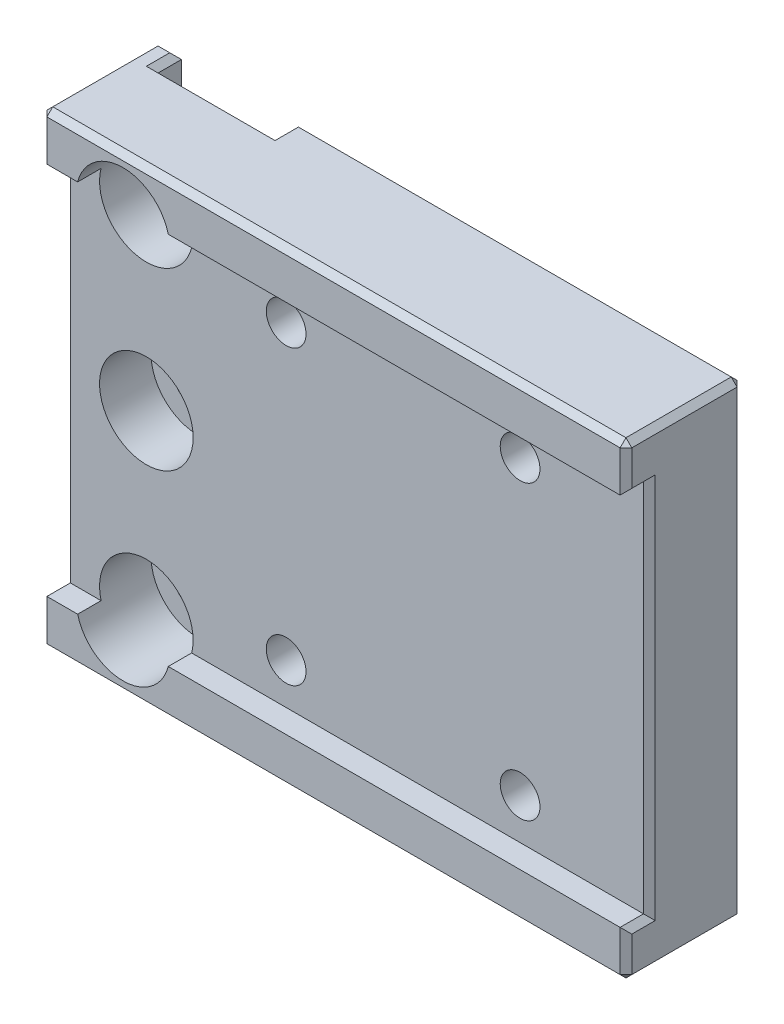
ISO-10303-21;
HEADER;
FILE_DESCRIPTION(('STEP AP214'),'2;1');
FILE_NAME('part.step','',(''),(''),'','','');
FILE_SCHEMA(('AUTOMOTIVE_DESIGN { 1 0 10303 214 1 1 1 1 }'));
ENDSEC;
DATA;
#1=APPLICATION_CONTEXT('core data for automotive mechanical design processes');
#2=APPLICATION_PROTOCOL_DEFINITION('international standard','automotive_design',2000,#1);
#3=PRODUCT_CONTEXT('',#1,'mechanical');
#4=PRODUCT('Part','Part','',(#3));
#5=PRODUCT_RELATED_PRODUCT_CATEGORY('part','',(#4));
#6=PRODUCT_DEFINITION_FORMATION('','',#4);
#7=PRODUCT_DEFINITION_CONTEXT('part definition',#1,'design');
#8=PRODUCT_DEFINITION('design','',#6,#7);
#9=PRODUCT_DEFINITION_SHAPE('','',#8);
#10=(LENGTH_UNIT() NAMED_UNIT(*) SI_UNIT(.MILLI.,.METRE.));
#11=(NAMED_UNIT(*) PLANE_ANGLE_UNIT() SI_UNIT($,.RADIAN.));
#12=(NAMED_UNIT(*) SI_UNIT($,.STERADIAN.) SOLID_ANGLE_UNIT());
#13=UNCERTAINTY_MEASURE_WITH_UNIT(LENGTH_MEASURE(1.E-05),#10,'distance_accuracy_value','');
#14=(GEOMETRIC_REPRESENTATION_CONTEXT(3) GLOBAL_UNCERTAINTY_ASSIGNED_CONTEXT((#13)) GLOBAL_UNIT_ASSIGNED_CONTEXT((#10,
#11,#12)) REPRESENTATION_CONTEXT('',''));
#15=CARTESIAN_POINT('',(0.,0.,0.));
#16=DIRECTION('',(0.,0.,1.));
#17=DIRECTION('',(1.,0.,0.));
#18=AXIS2_PLACEMENT_3D('',#15,#16,#17);
#19=CARTESIAN_POINT('',(25.,-16.,8.));
#20=DIRECTION('',(0.,-1.,0.));
#21=DIRECTION('',(1.,0.,0.));
#22=AXIS2_PLACEMENT_3D('',#19,#20,#21);
#23=PLANE('',#22);
#24=DIRECTION('',(1.,0.,0.));
#25=VECTOR('',#24,1.);
#26=CARTESIAN_POINT('',(0.,-16.,10.));
#27=LINE('',#26,#25);
#28=CARTESIAN_POINT('',(-14.1270166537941,-16.,10.));
#29=VERTEX_POINT('',#28);
#30=CARTESIAN_POINT('',(24.5,-16.,10.));
#31=VERTEX_POINT('',#30);
#32=EDGE_CURVE('E236',#29,#31,#27,.T.);
#33=ORIENTED_EDGE('',*,*,#32,.T.);
#34=DIRECTION('',(0.,0.,-1.));
#35=VECTOR('',#34,1.);
#36=CARTESIAN_POINT('',(24.5,-16.,8.));
#37=LINE('',#36,#35);
#38=CARTESIAN_POINT('',(24.5,-16.,8.));
#39=VERTEX_POINT('',#38);
#40=EDGE_CURVE('E25',#31,#39,#37,.T.);
#41=ORIENTED_EDGE('',*,*,#40,.T.);
#42=DIRECTION('',(-1.,0.,0.));
#43=VECTOR('',#42,1.);
#44=CARTESIAN_POINT('',(25.,-16.,8.));
#45=LINE('',#44,#43);
#46=CARTESIAN_POINT('',(-14.1270166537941,-16.,8.));
#47=VERTEX_POINT('',#46);
#48=EDGE_CURVE('E301',#39,#47,#45,.T.);
#49=ORIENTED_EDGE('',*,*,#48,.T.);
#50=DIRECTION('',(0.,0.,1.));
#51=VECTOR('',#50,1.);
#52=CARTESIAN_POINT('',(-14.1270166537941,-16.,7.));
#53=LINE('',#52,#51);
#54=EDGE_CURVE('E247',#47,#29,#53,.T.);
#55=ORIENTED_EDGE('',*,*,#54,.T.);
#56=EDGE_LOOP('',(#33,#41,#49,#55));
#57=FACE_BOUND('',#56,.T.);
#58=ADVANCED_FACE('F16',(#57),#23,.F.);
#59=CARTESIAN_POINT('',(25.,16.,8.));
#60=DIRECTION('',(0.,1.,0.));
#61=DIRECTION('',(-1.,0.,0.));
#62=AXIS2_PLACEMENT_3D('',#59,#60,#61);
#63=PLANE('',#62);
#64=DIRECTION('',(-1.,0.,0.));
#65=VECTOR('',#64,1.);
#66=CARTESIAN_POINT('',(0.,16.,10.));
#67=LINE('',#66,#65);
#68=CARTESIAN_POINT('',(-21.8729833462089,16.,10.));
#69=VERTEX_POINT('',#68);
#70=CARTESIAN_POINT('',(-24.5,16.,10.));
#71=VERTEX_POINT('',#70);
#72=EDGE_CURVE('E235',#69,#71,#67,.T.);
#73=ORIENTED_EDGE('',*,*,#72,.T.);
#74=DIRECTION('',(0.,0.,-1.));
#75=VECTOR('',#74,1.);
#76=CARTESIAN_POINT('',(-24.5,16.,8.));
#77=LINE('',#76,#75);
#78=CARTESIAN_POINT('',(-24.5,16.,8.));
#79=VERTEX_POINT('',#78);
#80=EDGE_CURVE('E426',#71,#79,#77,.T.);
#81=ORIENTED_EDGE('',*,*,#80,.T.);
#82=DIRECTION('',(-1.,0.,0.));
#83=VECTOR('',#82,1.);
#84=CARTESIAN_POINT('',(25.,16.,8.));
#85=LINE('',#84,#83);
#86=CARTESIAN_POINT('',(-21.8729833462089,16.,8.));
#87=VERTEX_POINT('',#86);
#88=EDGE_CURVE('E300',#87,#79,#85,.T.);
#89=ORIENTED_EDGE('',*,*,#88,.F.);
#90=DIRECTION('',(0.,0.,1.));
#91=VECTOR('',#90,1.);
#92=CARTESIAN_POINT('',(-21.8729833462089,16.,7.));
#93=LINE('',#92,#91);
#94=EDGE_CURVE('E266',#87,#69,#93,.T.);
#95=ORIENTED_EDGE('',*,*,#94,.T.);
#96=EDGE_LOOP('',(#73,#81,#89,#95));
#97=FACE_BOUND('',#96,.T.);
#98=ADVANCED_FACE('F619',(#97),#63,.F.);
#99=CARTESIAN_POINT('',(25.,-16.,8.));
#100=DIRECTION('',(0.,0.,-1.));
#101=DIRECTION('',(-1.,0.,0.));
#102=AXIS2_PLACEMENT_3D('',#99,#100,#101);
#103=PLANE('',#102);
#104=CARTESIAN_POINT('',(13.9499999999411,12.5,8.));
#105=DIRECTION('',(0.,0.,-1.));
#106=DIRECTION('',(-1.,0.,0.));
#107=AXIS2_PLACEMENT_3D('',#104,#105,#106);
#108=CIRCLE('',#107,1.7);
#109=CARTESIAN_POINT('',(12.2499999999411,12.5,8.));
#110=VERTEX_POINT('',#109);
#111=EDGE_CURVE('E334',#110,#110,#108,.T.);
#112=ORIENTED_EDGE('',*,*,#111,.T.);
#113=EDGE_LOOP('',(#112));
#114=FACE_BOUND('',#113,.T.);
#115=CARTESIAN_POINT('',(-6.05000000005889,12.5,8.));
#116=DIRECTION('',(0.,0.,-1.));
#117=DIRECTION('',(-1.,0.,0.));
#118=AXIS2_PLACEMENT_3D('',#115,#116,#117);
#119=CIRCLE('',#118,1.7);
#120=CARTESIAN_POINT('',(-7.75000000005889,12.5,8.));
#121=VERTEX_POINT('',#120);
#122=EDGE_CURVE('E329',#121,#121,#119,.T.);
#123=ORIENTED_EDGE('',*,*,#122,.T.);
#124=EDGE_LOOP('',(#123));
#125=FACE_BOUND('',#124,.T.);
#126=CARTESIAN_POINT('',(-6.05000000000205,-12.5,8.));
#127=DIRECTION('',(0.,0.,-1.));
#128=DIRECTION('',(-1.,0.,0.));
#129=AXIS2_PLACEMENT_3D('',#126,#127,#128);
#130=CIRCLE('',#129,1.7);
#131=CARTESIAN_POINT('',(-7.75000000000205,-12.5,8.));
#132=VERTEX_POINT('',#131);
#133=EDGE_CURVE('E324',#132,#132,#130,.T.);
#134=ORIENTED_EDGE('',*,*,#133,.T.);
#135=EDGE_LOOP('',(#134));
#136=FACE_BOUND('',#135,.T.);
#137=CARTESIAN_POINT('',(13.9499999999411,-12.5,8.));
#138=DIRECTION('',(0.,0.,-1.));
#139=DIRECTION('',(-1.,0.,0.));
#140=AXIS2_PLACEMENT_3D('',#137,#138,#139);
#141=CIRCLE('',#140,1.7);
#142=CARTESIAN_POINT('',(12.2499999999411,-12.5,8.));
#143=VERTEX_POINT('',#142);
#144=EDGE_CURVE('E252',#143,#143,#141,.T.);
#145=ORIENTED_EDGE('',*,*,#144,.T.);
#146=EDGE_LOOP('',(#145));
#147=FACE_BOUND('',#146,.T.);
#148=CARTESIAN_POINT('',(-18.0000000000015,0.,8.));
#149=DIRECTION('',(0.,0.,1.));
#150=DIRECTION('',(1.,0.,0.));
#151=AXIS2_PLACEMENT_3D('',#148,#149,#150);
#152=CIRCLE('',#151,4.);
#153=CARTESIAN_POINT('',(-14.0000000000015,0.,8.));
#154=VERTEX_POINT('',#153);
#155=EDGE_CURVE('E277',#154,#154,#152,.T.);
#156=ORIENTED_EDGE('',*,*,#155,.F.);
#157=EDGE_LOOP('',(#156));
#158=FACE_BOUND('',#157,.T.);
#159=ORIENTED_EDGE('',*,*,#88,.T.);
#160=DIRECTION('',(0.,-1.,0.));
#161=VECTOR('',#160,1.);
#162=CARTESIAN_POINT('',(-24.5,-16.,8.));
#163=LINE('',#162,#161);
#164=CARTESIAN_POINT('',(-24.5,-16.,8.));
#165=VERTEX_POINT('',#164);
#166=EDGE_CURVE('E424',#79,#165,#163,.T.);
#167=ORIENTED_EDGE('',*,*,#166,.T.);
#168=CARTESIAN_POINT('',(-21.8729833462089,-16.,8.));
#169=VERTEX_POINT('',#168);
#170=EDGE_CURVE('E303',#169,#165,#45,.T.);
#171=ORIENTED_EDGE('',*,*,#170,.F.);
#172=CARTESIAN_POINT('',(-18.0000000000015,-15.,8.));
#173=DIRECTION('',(0.,0.,1.));
#174=DIRECTION('',(1.,0.,0.));
#175=AXIS2_PLACEMENT_3D('',#172,#173,#174);
#176=CIRCLE('',#175,4.);
#177=EDGE_CURVE('E245',#47,#169,#176,.T.);
#178=ORIENTED_EDGE('',*,*,#177,.F.);
#179=ORIENTED_EDGE('',*,*,#48,.F.);
#180=DIRECTION('',(0.,1.,0.));
#181=VECTOR('',#180,1.);
#182=CARTESIAN_POINT('',(24.5,-16.,8.));
#183=LINE('',#182,#181);
#184=CARTESIAN_POINT('',(24.5,16.,8.));
#185=VERTEX_POINT('',#184);
#186=EDGE_CURVE('E422',#39,#185,#183,.T.);
#187=ORIENTED_EDGE('',*,*,#186,.T.);
#188=CARTESIAN_POINT('',(-14.1270166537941,16.,8.));
#189=VERTEX_POINT('',#188);
#190=EDGE_CURVE('E297',#185,#189,#85,.T.);
#191=ORIENTED_EDGE('',*,*,#190,.T.);
#192=CARTESIAN_POINT('',(-18.0000000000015,15.,8.));
#193=DIRECTION('',(0.,0.,1.));
#194=DIRECTION('',(1.,0.,0.));
#195=AXIS2_PLACEMENT_3D('',#192,#193,#194);
#196=CIRCLE('',#195,4.);
#197=EDGE_CURVE('E287',#87,#189,#196,.T.);
#198=ORIENTED_EDGE('',*,*,#197,.F.);
#199=EDGE_LOOP('',(#159,#167,#171,#178,#179,#187,#191,#198));
#200=FACE_BOUND('',#199,.T.);
#201=ADVANCED_FACE('F626',(#114,#125,#136,#147,#158,#200),#103,.F.);
#202=CARTESIAN_POINT('',(0.,0.,10.));
#203=DIRECTION('',(0.,0.,1.));
#204=DIRECTION('',(1.,0.,0.));
#205=AXIS2_PLACEMENT_3D('',#202,#203,#204);
#206=PLANE('',#205);
#207=DIRECTION('',(-1.,0.,0.));
#208=VECTOR('',#207,1.);
#209=CARTESIAN_POINT('',(-25.,19.5,10.));
#210=LINE('',#209,#208);
#211=CARTESIAN_POINT('',(24.5,19.5,10.));
#212=VERTEX_POINT('',#211);
#213=CARTESIAN_POINT('',(-24.5,19.5,10.));
#214=VERTEX_POINT('',#213);
#215=EDGE_CURVE('E430',#212,#214,#210,.T.);
#216=ORIENTED_EDGE('',*,*,#215,.T.);
#217=DIRECTION('',(0.,-1.,0.));
#218=VECTOR('',#217,1.);
#219=CARTESIAN_POINT('',(-24.5,16.,10.));
#220=LINE('',#219,#218);
#221=EDGE_CURVE('E432',#214,#71,#220,.T.);
#222=ORIENTED_EDGE('',*,*,#221,.T.);
#223=ORIENTED_EDGE('',*,*,#72,.F.);
#224=CARTESIAN_POINT('',(-18.0000000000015,15.,10.));
#225=DIRECTION('',(0.,0.,1.));
#226=DIRECTION('',(1.,0.,0.));
#227=AXIS2_PLACEMENT_3D('',#224,#225,#226);
#228=CIRCLE('',#227,4.);
#229=CARTESIAN_POINT('',(-14.1270166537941,16.,10.));
#230=VERTEX_POINT('',#229);
#231=EDGE_CURVE('E261',#230,#69,#228,.T.);
#232=ORIENTED_EDGE('',*,*,#231,.F.);
#233=CARTESIAN_POINT('',(24.5,16.,10.));
#234=VERTEX_POINT('',#233);
#235=EDGE_CURVE('E315',#234,#230,#67,.T.);
#236=ORIENTED_EDGE('',*,*,#235,.F.);
#237=DIRECTION('',(0.,1.,0.));
#238=VECTOR('',#237,1.);
#239=CARTESIAN_POINT('',(24.5,20.,10.));
#240=LINE('',#239,#238);
#241=EDGE_CURVE('E428',#234,#212,#240,.T.);
#242=ORIENTED_EDGE('',*,*,#241,.T.);
#243=EDGE_LOOP('',(#216,#222,#223,#232,#236,#242));
#244=FACE_BOUND('',#243,.T.);
#245=ADVANCED_FACE('F1286',(#244),#206,.T.);
#246=CARTESIAN_POINT('',(0.,0.,0.));
#247=DIRECTION('',(0.,0.,1.));
#248=DIRECTION('',(1.,0.,0.));
#249=AXIS2_PLACEMENT_3D('',#246,#247,#248);
#250=PLANE('',#249);
#251=DIRECTION('',(0.,1.,0.));
#252=VECTOR('',#251,1.);
#253=CARTESIAN_POINT('',(-23.,-20.,0.));
#254=LINE('',#253,#252);
#255=CARTESIAN_POINT('',(-23.,-19.5,0.));
#256=VERTEX_POINT('',#255);
#257=CARTESIAN_POINT('',(-23.,19.5,0.));
#258=VERTEX_POINT('',#257);
#259=EDGE_CURVE('E304',#256,#258,#254,.T.);
#260=ORIENTED_EDGE('',*,*,#259,.F.);
#261=DIRECTION('',(-1.,0.,0.));
#262=VECTOR('',#261,1.);
#263=CARTESIAN_POINT('',(0.,-19.5,0.));
#264=LINE('',#263,#262);
#265=CARTESIAN_POINT('',(-24.5,-19.5,0.));
#266=VERTEX_POINT('',#265);
#267=EDGE_CURVE('E385',#256,#266,#264,.T.);
#268=ORIENTED_EDGE('',*,*,#267,.T.);
#269=DIRECTION('',(0.,1.,0.));
#270=VECTOR('',#269,1.);
#271=CARTESIAN_POINT('',(-24.5,0.,0.));
#272=LINE('',#271,#270);
#273=CARTESIAN_POINT('',(-24.5,19.5,0.));
#274=VERTEX_POINT('',#273);
#275=EDGE_CURVE('E381',#266,#274,#272,.T.);
#276=ORIENTED_EDGE('',*,*,#275,.T.);
#277=DIRECTION('',(1.,0.,0.));
#278=VECTOR('',#277,1.);
#279=CARTESIAN_POINT('',(0.,19.5,0.));
#280=LINE('',#279,#278);
#281=EDGE_CURVE('E383',#274,#258,#280,.T.);
#282=ORIENTED_EDGE('',*,*,#281,.T.);
#283=EDGE_LOOP('',(#260,#268,#276,#282));
#284=FACE_BOUND('',#283,.T.);
#285=ADVANCED_FACE('F1267',(#284),#250,.F.);
#286=CARTESIAN_POINT('',(25.,20.,10.));
#287=DIRECTION('',(-1.,0.,0.));
#288=DIRECTION('',(0.,-1.,0.));
#289=AXIS2_PLACEMENT_3D('',#286,#287,#288);
#290=PLANE('',#289);
#291=DIRECTION('',(0.,1.,0.));
#292=VECTOR('',#291,1.);
#293=CARTESIAN_POINT('',(25.,20.,0.5));
#294=LINE('',#293,#292);
#295=CARTESIAN_POINT('',(25.,-19.5,0.5));
#296=VERTEX_POINT('',#295);
#297=CARTESIAN_POINT('',(25.,19.5,0.5));
#298=VERTEX_POINT('',#297);
#299=EDGE_CURVE('E33',#296,#298,#294,.T.);
#300=ORIENTED_EDGE('',*,*,#299,.T.);
#301=DIRECTION('',(0.,0.,1.));
#302=VECTOR('',#301,1.);
#303=CARTESIAN_POINT('',(25.,19.5,10.));
#304=LINE('',#303,#302);
#305=CARTESIAN_POINT('',(25.,19.5,9.5));
#306=VERTEX_POINT('',#305);
#307=EDGE_CURVE('E446',#298,#306,#304,.T.);
#308=ORIENTED_EDGE('',*,*,#307,.T.);
#309=DIRECTION('',(0.,-1.,0.));
#310=VECTOR('',#309,1.);
#311=CARTESIAN_POINT('',(25.,16.,9.5));
#312=LINE('',#311,#310);
#313=CARTESIAN_POINT('',(25.,16.5,9.5));
#314=VERTEX_POINT('',#313);
#315=EDGE_CURVE('E434',#306,#314,#312,.T.);
#316=ORIENTED_EDGE('',*,*,#315,.T.);
#317=DIRECTION('',(0.,0.,-1.));
#318=VECTOR('',#317,1.);
#319=CARTESIAN_POINT('',(25.,16.5,10.));
#320=LINE('',#319,#318);
#321=CARTESIAN_POINT('',(25.,16.5,7.5));
#322=VERTEX_POINT('',#321);
#323=EDGE_CURVE('E436',#314,#322,#320,.T.);
#324=ORIENTED_EDGE('',*,*,#323,.T.);
#325=DIRECTION('',(0.,-1.,0.));
#326=VECTOR('',#325,1.);
#327=CARTESIAN_POINT('',(25.,20.,7.5));
#328=LINE('',#327,#326);
#329=CARTESIAN_POINT('',(25.,-16.5,7.5));
#330=VERTEX_POINT('',#329);
#331=EDGE_CURVE('E438',#322,#330,#328,.T.);
#332=ORIENTED_EDGE('',*,*,#331,.T.);
#333=DIRECTION('',(0.,0.,1.));
#334=VECTOR('',#333,1.);
#335=CARTESIAN_POINT('',(25.,-16.5,10.));
#336=LINE('',#335,#334);
#337=CARTESIAN_POINT('',(25.,-16.5,9.5));
#338=VERTEX_POINT('',#337);
#339=EDGE_CURVE('E440',#330,#338,#336,.T.);
#340=ORIENTED_EDGE('',*,*,#339,.T.);
#341=DIRECTION('',(0.,-1.,0.));
#342=VECTOR('',#341,1.);
#343=CARTESIAN_POINT('',(25.,-20.,9.5));
#344=LINE('',#343,#342);
#345=CARTESIAN_POINT('',(25.,-19.5,9.5));
#346=VERTEX_POINT('',#345);
#347=EDGE_CURVE('E442',#338,#346,#344,.T.);
#348=ORIENTED_EDGE('',*,*,#347,.T.);
#349=DIRECTION('',(0.,0.,-1.));
#350=VECTOR('',#349,1.);
#351=CARTESIAN_POINT('',(25.,-19.5,10.));
#352=LINE('',#351,#350);
#353=EDGE_CURVE('E38',#346,#296,#352,.T.);
#354=ORIENTED_EDGE('',*,*,#353,.T.);
#355=EDGE_LOOP('',(#300,#308,#316,#324,#332,#340,#348,#354));
#356=FACE_BOUND('',#355,.T.);
#357=ADVANCED_FACE('F1263',(#356),#290,.F.);
#358=CARTESIAN_POINT('',(-25.,20.,10.));
#359=DIRECTION('',(0.,-1.,0.));
#360=DIRECTION('',(0.,0.,-1.));
#361=AXIS2_PLACEMENT_3D('',#358,#359,#360);
#362=PLANE('',#361);
#363=DIRECTION('',(-1.,0.,0.));
#364=VECTOR('',#363,1.);
#365=CARTESIAN_POINT('',(-25.,20.,0.5));
#366=LINE('',#365,#364);
#367=CARTESIAN_POINT('',(24.5,20.,0.5));
#368=VERTEX_POINT('',#367);
#369=CARTESIAN_POINT('',(-12.5,20.,0.5));
#370=VERTEX_POINT('',#369);
#371=EDGE_CURVE('E399',#368,#370,#366,.T.);
#372=ORIENTED_EDGE('',*,*,#371,.T.);
#373=DIRECTION('',(0.,0.,1.));
#374=VECTOR('',#373,1.);
#375=CARTESIAN_POINT('',(-12.5,20.,10.));
#376=LINE('',#375,#374);
#377=CARTESIAN_POINT('',(-12.5,20.,2.5));
#378=VERTEX_POINT('',#377);
#379=EDGE_CURVE('E401',#370,#378,#376,.T.);
#380=ORIENTED_EDGE('',*,*,#379,.T.);
#381=DIRECTION('',(-1.,0.,0.));
#382=VECTOR('',#381,1.);
#383=CARTESIAN_POINT('',(-25.,20.,2.5));
#384=LINE('',#383,#382);
#385=CARTESIAN_POINT('',(-23.5,20.,2.5));
#386=VERTEX_POINT('',#385);
#387=EDGE_CURVE('E397',#378,#386,#384,.T.);
#388=ORIENTED_EDGE('',*,*,#387,.T.);
#389=DIRECTION('',(0.,0.,-1.));
#390=VECTOR('',#389,1.);
#391=CARTESIAN_POINT('',(-23.5,20.,10.));
#392=LINE('',#391,#390);
#393=CARTESIAN_POINT('',(-23.5,20.,0.5));
#394=VERTEX_POINT('',#393);
#395=EDGE_CURVE('E395',#386,#394,#392,.T.);
#396=ORIENTED_EDGE('',*,*,#395,.T.);
#397=DIRECTION('',(-1.,0.,0.));
#398=VECTOR('',#397,1.);
#399=CARTESIAN_POINT('',(-25.,20.,0.5));
#400=LINE('',#399,#398);
#401=CARTESIAN_POINT('',(-24.5,20.,0.5));
#402=VERTEX_POINT('',#401);
#403=EDGE_CURVE('E393',#394,#402,#400,.T.);
#404=ORIENTED_EDGE('',*,*,#403,.T.);
#405=DIRECTION('',(0.,0.,1.));
#406=VECTOR('',#405,1.);
#407=CARTESIAN_POINT('',(-24.5,20.,10.));
#408=LINE('',#407,#406);
#409=CARTESIAN_POINT('',(-24.5,20.,9.5));
#410=VERTEX_POINT('',#409);
#411=EDGE_CURVE('E391',#402,#410,#408,.T.);
#412=ORIENTED_EDGE('',*,*,#411,.T.);
#413=DIRECTION('',(1.,0.,0.));
#414=VECTOR('',#413,1.);
#415=CARTESIAN_POINT('',(25.,20.,9.5));
#416=LINE('',#415,#414);
#417=CARTESIAN_POINT('',(24.5,20.,9.5));
#418=VERTEX_POINT('',#417);
#419=EDGE_CURVE('E389',#410,#418,#416,.T.);
#420=ORIENTED_EDGE('',*,*,#419,.T.);
#421=DIRECTION('',(0.,0.,-1.));
#422=VECTOR('',#421,1.);
#423=CARTESIAN_POINT('',(24.5,20.,10.));
#424=LINE('',#423,#422);
#425=EDGE_CURVE('E387',#418,#368,#424,.T.);
#426=ORIENTED_EDGE('',*,*,#425,.T.);
#427=EDGE_LOOP('',(#372,#380,#388,#396,#404,#412,#420,#426));
#428=FACE_BOUND('',#427,.T.);
#429=ADVANCED_FACE('F1266',(#428),#362,.F.);
#430=CARTESIAN_POINT('',(-25.,20.,10.));
#431=DIRECTION('',(1.,0.,0.));
#432=DIRECTION('',(0.,1.,0.));
#433=AXIS2_PLACEMENT_3D('',#430,#431,#432);
#434=PLANE('',#433);
#435=DIRECTION('',(0.,1.,0.));
#436=VECTOR('',#435,1.);
#437=CARTESIAN_POINT('',(-25.,-16.,9.5));
#438=LINE('',#437,#436);
#439=CARTESIAN_POINT('',(-25.,-19.5,9.5));
#440=VERTEX_POINT('',#439);
#441=CARTESIAN_POINT('',(-25.,-16.5,9.5));
#442=VERTEX_POINT('',#441);
#443=EDGE_CURVE('E417',#440,#442,#438,.T.);
#444=ORIENTED_EDGE('',*,*,#443,.T.);
#445=DIRECTION('',(0.,0.,-1.));
#446=VECTOR('',#445,1.);
#447=CARTESIAN_POINT('',(-25.,-16.5,10.));
#448=LINE('',#447,#446);
#449=CARTESIAN_POINT('',(-25.,-16.5,7.5));
#450=VERTEX_POINT('',#449);
#451=EDGE_CURVE('E419',#442,#450,#448,.T.);
#452=ORIENTED_EDGE('',*,*,#451,.T.);
#453=DIRECTION('',(0.,1.,0.));
#454=VECTOR('',#453,1.);
#455=CARTESIAN_POINT('',(-25.,20.,7.5));
#456=LINE('',#455,#454);
#457=CARTESIAN_POINT('',(-25.,16.5,7.5));
#458=VERTEX_POINT('',#457);
#459=EDGE_CURVE('E409',#450,#458,#456,.T.);
#460=ORIENTED_EDGE('',*,*,#459,.T.);
#461=DIRECTION('',(0.,0.,1.));
#462=VECTOR('',#461,1.);
#463=CARTESIAN_POINT('',(-25.,16.5,10.));
#464=LINE('',#463,#462);
#465=CARTESIAN_POINT('',(-25.,16.5,9.5));
#466=VERTEX_POINT('',#465);
#467=EDGE_CURVE('E407',#458,#466,#464,.T.);
#468=ORIENTED_EDGE('',*,*,#467,.T.);
#469=DIRECTION('',(0.,1.,0.));
#470=VECTOR('',#469,1.);
#471=CARTESIAN_POINT('',(-25.,20.,9.5));
#472=LINE('',#471,#470);
#473=CARTESIAN_POINT('',(-25.,19.5,9.5));
#474=VERTEX_POINT('',#473);
#475=EDGE_CURVE('E405',#466,#474,#472,.T.);
#476=ORIENTED_EDGE('',*,*,#475,.T.);
#477=DIRECTION('',(0.,0.,-1.));
#478=VECTOR('',#477,1.);
#479=CARTESIAN_POINT('',(-25.,19.5,10.));
#480=LINE('',#479,#478);
#481=CARTESIAN_POINT('',(-25.,19.5,0.5));
#482=VERTEX_POINT('',#481);
#483=EDGE_CURVE('E411',#474,#482,#480,.T.);
#484=ORIENTED_EDGE('',*,*,#483,.T.);
#485=DIRECTION('',(0.,-1.,0.));
#486=VECTOR('',#485,1.);
#487=CARTESIAN_POINT('',(-25.,20.,0.5));
#488=LINE('',#487,#486);
#489=CARTESIAN_POINT('',(-25.,-19.5,0.5));
#490=VERTEX_POINT('',#489);
#491=EDGE_CURVE('E413',#482,#490,#488,.T.);
#492=ORIENTED_EDGE('',*,*,#491,.T.);
#493=DIRECTION('',(0.,0.,1.));
#494=VECTOR('',#493,1.);
#495=CARTESIAN_POINT('',(-25.,-19.5,10.));
#496=LINE('',#495,#494);
#497=EDGE_CURVE('E415',#490,#440,#496,.T.);
#498=ORIENTED_EDGE('',*,*,#497,.T.);
#499=EDGE_LOOP('',(#444,#452,#460,#468,#476,#484,#492,#498));
#500=FACE_BOUND('',#499,.T.);
#501=ADVANCED_FACE('F1270',(#500),#434,.F.);
#502=CARTESIAN_POINT('',(-25.,-20.,10.));
#503=DIRECTION('',(0.,1.,0.));
#504=DIRECTION('',(0.,0.,1.));
#505=AXIS2_PLACEMENT_3D('',#502,#503,#504);
#506=PLANE('',#505);
#507=DIRECTION('',(1.,0.,0.));
#508=VECTOR('',#507,1.);
#509=CARTESIAN_POINT('',(-25.,-20.,2.5));
#510=LINE('',#509,#508);
#511=CARTESIAN_POINT('',(-23.5,-20.,2.5));
#512=VERTEX_POINT('',#511);
#513=CARTESIAN_POINT('',(-12.5,-20.,2.5));
#514=VERTEX_POINT('',#513);
#515=EDGE_CURVE('E358',#512,#514,#510,.T.);
#516=ORIENTED_EDGE('',*,*,#515,.T.);
#517=DIRECTION('',(0.,0.,-1.));
#518=VECTOR('',#517,1.);
#519=CARTESIAN_POINT('',(-12.5,-20.,10.));
#520=LINE('',#519,#518);
#521=CARTESIAN_POINT('',(-12.5,-20.,0.5));
#522=VERTEX_POINT('',#521);
#523=EDGE_CURVE('E360',#514,#522,#520,.T.);
#524=ORIENTED_EDGE('',*,*,#523,.T.);
#525=DIRECTION('',(1.,0.,0.));
#526=VECTOR('',#525,1.);
#527=CARTESIAN_POINT('',(-25.,-20.,0.5));
#528=LINE('',#527,#526);
#529=CARTESIAN_POINT('',(24.5,-20.,0.5));
#530=VERTEX_POINT('',#529);
#531=EDGE_CURVE('E347',#522,#530,#528,.T.);
#532=ORIENTED_EDGE('',*,*,#531,.T.);
#533=DIRECTION('',(0.,0.,1.));
#534=VECTOR('',#533,1.);
#535=CARTESIAN_POINT('',(24.5,-20.,10.));
#536=LINE('',#535,#534);
#537=CARTESIAN_POINT('',(24.5,-20.,9.5));
#538=VERTEX_POINT('',#537);
#539=EDGE_CURVE('E345',#530,#538,#536,.T.);
#540=ORIENTED_EDGE('',*,*,#539,.T.);
#541=DIRECTION('',(-1.,0.,0.));
#542=VECTOR('',#541,1.);
#543=CARTESIAN_POINT('',(-25.,-20.,9.5));
#544=LINE('',#543,#542);
#545=CARTESIAN_POINT('',(-24.5,-20.,9.5));
#546=VERTEX_POINT('',#545);
#547=EDGE_CURVE('E349',#538,#546,#544,.T.);
#548=ORIENTED_EDGE('',*,*,#547,.T.);
#549=DIRECTION('',(0.,0.,-1.));
#550=VECTOR('',#549,1.);
#551=CARTESIAN_POINT('',(-24.5,-20.,10.));
#552=LINE('',#551,#550);
#553=CARTESIAN_POINT('',(-24.5,-20.,0.5));
#554=VERTEX_POINT('',#553);
#555=EDGE_CURVE('E352',#546,#554,#552,.T.);
#556=ORIENTED_EDGE('',*,*,#555,.T.);
#557=DIRECTION('',(1.,0.,0.));
#558=VECTOR('',#557,1.);
#559=CARTESIAN_POINT('',(-25.,-20.,0.5));
#560=LINE('',#559,#558);
#561=CARTESIAN_POINT('',(-23.5,-20.,0.5));
#562=VERTEX_POINT('',#561);
#563=EDGE_CURVE('E354',#554,#562,#560,.T.);
#564=ORIENTED_EDGE('',*,*,#563,.T.);
#565=DIRECTION('',(0.,0.,1.));
#566=VECTOR('',#565,1.);
#567=CARTESIAN_POINT('',(-23.5,-20.,10.));
#568=LINE('',#567,#566);
#569=EDGE_CURVE('E356',#562,#512,#568,.T.);
#570=ORIENTED_EDGE('',*,*,#569,.T.);
#571=EDGE_LOOP('',(#516,#524,#532,#540,#548,#556,#564,#570));
#572=FACE_BOUND('',#571,.T.);
#573=ADVANCED_FACE('F1274',(#572),#506,.F.);
#574=CARTESIAN_POINT('',(-24.5,-16.,10.));
#575=VERTEX_POINT('',#574);
#576=CARTESIAN_POINT('',(-21.8729833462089,-16.,10.));
#577=VERTEX_POINT('',#576);
#578=EDGE_CURVE('E224',#575,#577,#27,.T.);
#579=ORIENTED_EDGE('',*,*,#578,.F.);
#580=DIRECTION('',(0.,-1.,0.));
#581=VECTOR('',#580,1.);
#582=CARTESIAN_POINT('',(-24.5,-20.,10.));
#583=LINE('',#582,#581);
#584=CARTESIAN_POINT('',(-24.5,-19.5,10.));
#585=VERTEX_POINT('',#584);
#586=EDGE_CURVE('E343',#575,#585,#583,.T.);
#587=ORIENTED_EDGE('',*,*,#586,.T.);
#588=DIRECTION('',(1.,0.,0.));
#589=VECTOR('',#588,1.);
#590=CARTESIAN_POINT('',(25.,-19.5,10.));
#591=LINE('',#590,#589);
#592=CARTESIAN_POINT('',(24.5,-19.5,10.));
#593=VERTEX_POINT('',#592);
#594=EDGE_CURVE('E340',#585,#593,#591,.T.);
#595=ORIENTED_EDGE('',*,*,#594,.T.);
#596=DIRECTION('',(0.,1.,0.));
#597=VECTOR('',#596,1.);
#598=CARTESIAN_POINT('',(24.5,-16.,10.));
#599=LINE('',#598,#597);
#600=EDGE_CURVE('E317',#593,#31,#599,.T.);
#601=ORIENTED_EDGE('',*,*,#600,.T.);
#602=ORIENTED_EDGE('',*,*,#32,.F.);
#603=CARTESIAN_POINT('',(-18.0000000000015,-15.,10.));
#604=DIRECTION('',(0.,0.,1.));
#605=DIRECTION('',(1.,0.,0.));
#606=AXIS2_PLACEMENT_3D('',#603,#604,#605);
#607=CIRCLE('',#606,4.);
#608=EDGE_CURVE('E242',#577,#29,#607,.T.);
#609=ORIENTED_EDGE('',*,*,#608,.F.);
#610=EDGE_LOOP('',(#579,#587,#595,#601,#602,#609));
#611=FACE_BOUND('',#610,.T.);
#612=ADVANCED_FACE('F250',(#611),#206,.T.);
#613=CARTESIAN_POINT('',(13.9499999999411,12.5,0.));
#614=DIRECTION('',(0.,0.,-1.));
#615=DIRECTION('',(-1.,0.,0.));
#616=AXIS2_PLACEMENT_3D('',#613,#614,#615);
#617=CIRCLE('',#616,3.25);
#618=CARTESIAN_POINT('',(10.6999999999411,12.5,0.));
#619=VERTEX_POINT('',#618);
#620=EDGE_CURVE('E564',#619,#619,#617,.T.);
#621=ORIENTED_EDGE('',*,*,#620,.F.);
#622=EDGE_LOOP('',(#621));
#623=FACE_BOUND('',#622,.T.);
#624=CARTESIAN_POINT('',(-6.05000000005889,12.5,0.));
#625=DIRECTION('',(0.,0.,-1.));
#626=DIRECTION('',(-1.,0.,0.));
#627=AXIS2_PLACEMENT_3D('',#624,#625,#626);
#628=CIRCLE('',#627,3.25);
#629=CARTESIAN_POINT('',(-9.30000000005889,12.5,0.));
#630=VERTEX_POINT('',#629);
#631=EDGE_CURVE('E337',#630,#630,#628,.T.);
#632=ORIENTED_EDGE('',*,*,#631,.F.);
#633=EDGE_LOOP('',(#632));
#634=FACE_BOUND('',#633,.T.);
#635=CARTESIAN_POINT('',(-6.05000000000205,-12.5,0.));
#636=DIRECTION('',(0.,0.,-1.));
#637=DIRECTION('',(-1.,0.,0.));
#638=AXIS2_PLACEMENT_3D('',#635,#636,#637);
#639=CIRCLE('',#638,3.25);
#640=CARTESIAN_POINT('',(-9.30000000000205,-12.5,0.));
#641=VERTEX_POINT('',#640);
#642=EDGE_CURVE('E332',#641,#641,#639,.T.);
#643=ORIENTED_EDGE('',*,*,#642,.F.);
#644=EDGE_LOOP('',(#643));
#645=FACE_BOUND('',#644,.T.);
#646=CARTESIAN_POINT('',(13.9499999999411,-12.5,0.));
#647=DIRECTION('',(0.,0.,-1.));
#648=DIRECTION('',(-1.,0.,0.));
#649=AXIS2_PLACEMENT_3D('',#646,#647,#648);
#650=CIRCLE('',#649,3.25);
#651=CARTESIAN_POINT('',(10.6999999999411,-12.5,0.));
#652=VERTEX_POINT('',#651);
#653=EDGE_CURVE('E327',#652,#652,#650,.T.);
#654=ORIENTED_EDGE('',*,*,#653,.F.);
#655=EDGE_LOOP('',(#654));
#656=FACE_BOUND('',#655,.T.);
#657=DIRECTION('',(0.,-1.,0.));
#658=VECTOR('',#657,1.);
#659=CARTESIAN_POINT('',(24.5,0.,0.));
#660=LINE('',#659,#658);
#661=CARTESIAN_POINT('',(24.5,19.5,0.));
#662=VERTEX_POINT('',#661);
#663=CARTESIAN_POINT('',(24.5,-19.5,0.));
#664=VERTEX_POINT('',#663);
#665=EDGE_CURVE('E362',#662,#664,#660,.T.);
#666=ORIENTED_EDGE('',*,*,#665,.T.);
#667=DIRECTION('',(-1.,0.,0.));
#668=VECTOR('',#667,1.);
#669=CARTESIAN_POINT('',(0.,-19.5,0.));
#670=LINE('',#669,#668);
#671=CARTESIAN_POINT('',(-13.,-19.5,0.));
#672=VERTEX_POINT('',#671);
#673=EDGE_CURVE('E366',#664,#672,#670,.T.);
#674=ORIENTED_EDGE('',*,*,#673,.T.);
#675=DIRECTION('',(0.,1.,0.));
#676=VECTOR('',#675,1.);
#677=CARTESIAN_POINT('',(-13.,-20.,0.));
#678=LINE('',#677,#676);
#679=CARTESIAN_POINT('',(-13.,19.5,0.));
#680=VERTEX_POINT('',#679);
#681=EDGE_CURVE('E307',#672,#680,#678,.T.);
#682=ORIENTED_EDGE('',*,*,#681,.T.);
#683=DIRECTION('',(1.,0.,0.));
#684=VECTOR('',#683,1.);
#685=CARTESIAN_POINT('',(0.,19.5,0.));
#686=LINE('',#685,#684);
#687=EDGE_CURVE('E364',#680,#662,#686,.T.);
#688=ORIENTED_EDGE('',*,*,#687,.T.);
#689=EDGE_LOOP('',(#666,#674,#682,#688));
#690=FACE_BOUND('',#689,.T.);
#691=ADVANCED_FACE('F1279',(#623,#634,#645,#656,#690),#250,.F.);
#692=CARTESIAN_POINT('',(-23.,-20.,2.));
#693=DIRECTION('',(-1.,0.,0.));
#694=DIRECTION('',(0.,0.,1.));
#695=AXIS2_PLACEMENT_3D('',#692,#693,#694);
#696=PLANE('',#695);
#697=DIRECTION('',(0.,1.,0.));
#698=VECTOR('',#697,1.);
#699=CARTESIAN_POINT('',(-23.,-20.,2.));
#700=LINE('',#699,#698);
#701=CARTESIAN_POINT('',(-23.,-19.5,2.));
#702=VERTEX_POINT('',#701);
#703=CARTESIAN_POINT('',(-23.,19.5,2.));
#704=VERTEX_POINT('',#703);
#705=EDGE_CURVE('E299',#702,#704,#700,.T.);
#706=ORIENTED_EDGE('',*,*,#705,.F.);
#707=DIRECTION('',(0.,0.,-1.));
#708=VECTOR('',#707,1.);
#709=CARTESIAN_POINT('',(-23.,-19.5,2.));
#710=LINE('',#709,#708);
#711=EDGE_CURVE('E379',#702,#256,#710,.T.);
#712=ORIENTED_EDGE('',*,*,#711,.T.);
#713=ORIENTED_EDGE('',*,*,#259,.T.);
#714=DIRECTION('',(0.,0.,1.));
#715=VECTOR('',#714,1.);
#716=CARTESIAN_POINT('',(-23.,19.5,2.));
#717=LINE('',#716,#715);
#718=EDGE_CURVE('E377',#258,#704,#717,.T.);
#719=ORIENTED_EDGE('',*,*,#718,.T.);
#720=EDGE_LOOP('',(#706,#712,#713,#719));
#721=FACE_BOUND('',#720,.T.);
#722=ADVANCED_FACE('F1282',(#721),#696,.F.);
#723=CARTESIAN_POINT('',(-13.,-20.,2.));
#724=DIRECTION('',(1.,0.,0.));
#725=DIRECTION('',(0.,0.,-1.));
#726=AXIS2_PLACEMENT_3D('',#723,#724,#725);
#727=PLANE('',#726);
#728=ORIENTED_EDGE('',*,*,#681,.F.);
#729=DIRECTION('',(0.,0.,1.));
#730=VECTOR('',#729,1.);
#731=CARTESIAN_POINT('',(-13.,-19.5,2.));
#732=LINE('',#731,#730);
#733=CARTESIAN_POINT('',(-13.,-19.5,2.));
#734=VERTEX_POINT('',#733);
#735=EDGE_CURVE('E371',#672,#734,#732,.T.);
#736=ORIENTED_EDGE('',*,*,#735,.T.);
#737=DIRECTION('',(0.,1.,0.));
#738=VECTOR('',#737,1.);
#739=CARTESIAN_POINT('',(-13.,-20.,2.));
#740=LINE('',#739,#738);
#741=CARTESIAN_POINT('',(-13.,19.5,2.));
#742=VERTEX_POINT('',#741);
#743=EDGE_CURVE('E310',#734,#742,#740,.T.);
#744=ORIENTED_EDGE('',*,*,#743,.T.);
#745=DIRECTION('',(0.,0.,-1.));
#746=VECTOR('',#745,1.);
#747=CARTESIAN_POINT('',(-13.,19.5,2.));
#748=LINE('',#747,#746);
#749=EDGE_CURVE('E369',#742,#680,#748,.T.);
#750=ORIENTED_EDGE('',*,*,#749,.T.);
#751=EDGE_LOOP('',(#728,#736,#744,#750));
#752=FACE_BOUND('',#751,.T.);
#753=ADVANCED_FACE('F647',(#752),#727,.F.);
#754=CARTESIAN_POINT('',(-23.,-20.,2.));
#755=DIRECTION('',(0.,0.,1.));
#756=DIRECTION('',(1.,0.,0.));
#757=AXIS2_PLACEMENT_3D('',#754,#755,#756);
#758=PLANE('',#757);
#759=CARTESIAN_POINT('',(-18.0000000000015,-15.,2.));
#760=DIRECTION('',(0.,0.,1.));
#761=DIRECTION('',(1.,0.,0.));
#762=AXIS2_PLACEMENT_3D('',#759,#760,#761);
#763=CIRCLE('',#762,2.25);
#764=CARTESIAN_POINT('',(-15.7500000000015,-15.,2.));
#765=VERTEX_POINT('',#764);
#766=EDGE_CURVE('E276',#765,#765,#763,.T.);
#767=ORIENTED_EDGE('',*,*,#766,.T.);
#768=EDGE_LOOP('',(#767));
#769=FACE_BOUND('',#768,.T.);
#770=CARTESIAN_POINT('',(-18.0000000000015,0.,2.));
#771=DIRECTION('',(0.,0.,1.));
#772=DIRECTION('',(1.,0.,0.));
#773=AXIS2_PLACEMENT_3D('',#770,#771,#772);
#774=CIRCLE('',#773,2.25);
#775=CARTESIAN_POINT('',(-15.7500000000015,0.,2.));
#776=VERTEX_POINT('',#775);
#777=EDGE_CURVE('E286',#776,#776,#774,.T.);
#778=ORIENTED_EDGE('',*,*,#777,.T.);
#779=EDGE_LOOP('',(#778));
#780=FACE_BOUND('',#779,.T.);
#781=CARTESIAN_POINT('',(-18.0000000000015,15.,2.));
#782=DIRECTION('',(0.,0.,1.));
#783=DIRECTION('',(1.,0.,0.));
#784=AXIS2_PLACEMENT_3D('',#781,#782,#783);
#785=CIRCLE('',#784,2.25);
#786=CARTESIAN_POINT('',(-15.7500000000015,15.,2.));
#787=VERTEX_POINT('',#786);
#788=EDGE_CURVE('E296',#787,#787,#785,.T.);
#789=ORIENTED_EDGE('',*,*,#788,.T.);
#790=EDGE_LOOP('',(#789));
#791=FACE_BOUND('',#790,.T.);
#792=ORIENTED_EDGE('',*,*,#743,.F.);
#793=DIRECTION('',(-1.,0.,0.));
#794=VECTOR('',#793,1.);
#795=CARTESIAN_POINT('',(-23.,-19.5,2.));
#796=LINE('',#795,#794);
#797=EDGE_CURVE('E375',#734,#702,#796,.T.);
#798=ORIENTED_EDGE('',*,*,#797,.T.);
#799=ORIENTED_EDGE('',*,*,#705,.T.);
#800=DIRECTION('',(1.,0.,0.));
#801=VECTOR('',#800,1.);
#802=CARTESIAN_POINT('',(-23.,19.5,2.));
#803=LINE('',#802,#801);
#804=EDGE_CURVE('E373',#704,#742,#803,.T.);
#805=ORIENTED_EDGE('',*,*,#804,.T.);
#806=EDGE_LOOP('',(#792,#798,#799,#805));
#807=FACE_BOUND('',#806,.T.);
#808=ADVANCED_FACE('F641',(#769,#780,#791,#807),#758,.F.);
#809=ORIENTED_EDGE('',*,*,#190,.F.);
#810=DIRECTION('',(0.,0.,1.));
#811=VECTOR('',#810,1.);
#812=CARTESIAN_POINT('',(24.5,16.,8.));
#813=LINE('',#812,#811);
#814=EDGE_CURVE('E11',#185,#234,#813,.T.);
#815=ORIENTED_EDGE('',*,*,#814,.T.);
#816=ORIENTED_EDGE('',*,*,#235,.T.);
#817=DIRECTION('',(0.,0.,1.));
#818=VECTOR('',#817,1.);
#819=CARTESIAN_POINT('',(-14.1270166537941,16.,7.));
#820=LINE('',#819,#818);
#821=EDGE_CURVE('E263',#230,#189,#820,.F.);
#822=ORIENTED_EDGE('',*,*,#821,.T.);
#823=EDGE_LOOP('',(#809,#815,#816,#822));
#824=FACE_BOUND('',#823,.T.);
#825=ADVANCED_FACE('F629',(#824),#63,.F.);
#826=ORIENTED_EDGE('',*,*,#170,.T.);
#827=DIRECTION('',(0.,0.,1.));
#828=VECTOR('',#827,1.);
#829=CARTESIAN_POINT('',(-24.5,-16.,8.));
#830=LINE('',#829,#828);
#831=EDGE_CURVE('E231',#165,#575,#830,.T.);
#832=ORIENTED_EDGE('',*,*,#831,.T.);
#833=ORIENTED_EDGE('',*,*,#578,.T.);
#834=DIRECTION('',(0.,0.,1.));
#835=VECTOR('',#834,1.);
#836=CARTESIAN_POINT('',(-21.8729833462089,-16.,7.));
#837=LINE('',#836,#835);
#838=EDGE_CURVE('E228',#577,#169,#837,.F.);
#839=ORIENTED_EDGE('',*,*,#838,.T.);
#840=EDGE_LOOP('',(#826,#832,#833,#839));
#841=FACE_BOUND('',#840,.T.);
#842=ADVANCED_FACE('F227',(#841),#23,.F.);
#843=CARTESIAN_POINT('',(-18.0000000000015,15.,8.));
#844=DIRECTION('',(0.,0.,1.));
#845=DIRECTION('',(1.,0.,0.));
#846=AXIS2_PLACEMENT_3D('',#843,#844,#845);
#847=CYLINDRICAL_SURFACE('',#846,2.25);
#848=CARTESIAN_POINT('',(-18.0000000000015,15.,3.6));
#849=DIRECTION('',(0.,0.,1.));
#850=DIRECTION('',(1.,0.,0.));
#851=AXIS2_PLACEMENT_3D('',#848,#849,#850);
#852=CIRCLE('',#851,2.25);
#853=CARTESIAN_POINT('',(-15.7500000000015,15.,3.6));
#854=VERTEX_POINT('',#853);
#855=EDGE_CURVE('E293',#854,#854,#852,.T.);
#856=ORIENTED_EDGE('',*,*,#855,.T.);
#857=EDGE_LOOP('',(#856));
#858=FACE_BOUND('',#857,.T.);
#859=ORIENTED_EDGE('',*,*,#788,.F.);
#860=EDGE_LOOP('',(#859));
#861=FACE_BOUND('',#860,.T.);
#862=ADVANCED_FACE('F632',(#858,#861),#847,.F.);
#863=CARTESIAN_POINT('',(-15.7500000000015,15.,3.6));
#864=DIRECTION('',(0.,0.,-1.));
#865=DIRECTION('',(-1.,0.,0.));
#866=AXIS2_PLACEMENT_3D('',#863,#864,#865);
#867=PLANE('',#866);
#868=ORIENTED_EDGE('',*,*,#855,.F.);
#869=EDGE_LOOP('',(#868));
#870=FACE_BOUND('',#869,.T.);
#871=CARTESIAN_POINT('',(-18.0000000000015,15.,3.6));
#872=DIRECTION('',(0.,0.,1.));
#873=DIRECTION('',(1.,0.,0.));
#874=AXIS2_PLACEMENT_3D('',#871,#872,#873);
#875=CIRCLE('',#874,4.);
#876=CARTESIAN_POINT('',(-14.0000000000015,15.,3.6));
#877=VERTEX_POINT('',#876);
#878=EDGE_CURVE('E290',#877,#877,#875,.T.);
#879=ORIENTED_EDGE('',*,*,#878,.T.);
#880=EDGE_LOOP('',(#879));
#881=FACE_BOUND('',#880,.T.);
#882=ADVANCED_FACE('F638',(#870,#881),#867,.F.);
#883=CARTESIAN_POINT('',(-18.0000000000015,15.,8.));
#884=DIRECTION('',(0.,0.,1.));
#885=DIRECTION('',(1.,0.,0.));
#886=AXIS2_PLACEMENT_3D('',#883,#884,#885);
#887=CYLINDRICAL_SURFACE('',#886,4.);
#888=ORIENTED_EDGE('',*,*,#197,.T.);
#889=ORIENTED_EDGE('',*,*,#821,.F.);
#890=ORIENTED_EDGE('',*,*,#231,.T.);
#891=ORIENTED_EDGE('',*,*,#94,.F.);
#892=EDGE_LOOP('',(#888,#889,#890,#891));
#893=FACE_BOUND('',#892,.T.);
#894=ORIENTED_EDGE('',*,*,#878,.F.);
#895=EDGE_LOOP('',(#894));
#896=FACE_BOUND('',#895,.T.);
#897=ADVANCED_FACE('F654',(#893,#896),#887,.F.);
#898=CARTESIAN_POINT('',(-18.0000000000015,0.,8.));
#899=DIRECTION('',(0.,0.,1.));
#900=DIRECTION('',(1.,0.,0.));
#901=AXIS2_PLACEMENT_3D('',#898,#899,#900);
#902=CYLINDRICAL_SURFACE('',#901,2.25);
#903=CARTESIAN_POINT('',(-18.0000000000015,0.,3.6));
#904=DIRECTION('',(0.,0.,1.));
#905=DIRECTION('',(1.,0.,0.));
#906=AXIS2_PLACEMENT_3D('',#903,#904,#905);
#907=CIRCLE('',#906,2.25);
#908=CARTESIAN_POINT('',(-15.7500000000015,0.,3.6));
#909=VERTEX_POINT('',#908);
#910=EDGE_CURVE('E283',#909,#909,#907,.T.);
#911=ORIENTED_EDGE('',*,*,#910,.T.);
#912=EDGE_LOOP('',(#911));
#913=FACE_BOUND('',#912,.T.);
#914=ORIENTED_EDGE('',*,*,#777,.F.);
#915=EDGE_LOOP('',(#914));
#916=FACE_BOUND('',#915,.T.);
#917=ADVANCED_FACE('F658',(#913,#916),#902,.F.);
#918=CARTESIAN_POINT('',(-15.7500000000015,0.,3.6));
#919=DIRECTION('',(0.,0.,-1.));
#920=DIRECTION('',(-1.,0.,0.));
#921=AXIS2_PLACEMENT_3D('',#918,#919,#920);
#922=PLANE('',#921);
#923=ORIENTED_EDGE('',*,*,#910,.F.);
#924=EDGE_LOOP('',(#923));
#925=FACE_BOUND('',#924,.T.);
#926=CARTESIAN_POINT('',(-18.0000000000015,0.,3.6));
#927=DIRECTION('',(0.,0.,1.));
#928=DIRECTION('',(1.,0.,0.));
#929=AXIS2_PLACEMENT_3D('',#926,#927,#928);
#930=CIRCLE('',#929,4.);
#931=CARTESIAN_POINT('',(-14.0000000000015,0.,3.6));
#932=VERTEX_POINT('',#931);
#933=EDGE_CURVE('E280',#932,#932,#930,.T.);
#934=ORIENTED_EDGE('',*,*,#933,.T.);
#935=EDGE_LOOP('',(#934));
#936=FACE_BOUND('',#935,.T.);
#937=ADVANCED_FACE('F662',(#925,#936),#922,.F.);
#938=CARTESIAN_POINT('',(-18.0000000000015,0.,8.));
#939=DIRECTION('',(0.,0.,1.));
#940=DIRECTION('',(1.,0.,0.));
#941=AXIS2_PLACEMENT_3D('',#938,#939,#940);
#942=CYLINDRICAL_SURFACE('',#941,4.);
#943=ORIENTED_EDGE('',*,*,#933,.F.);
#944=EDGE_LOOP('',(#943));
#945=FACE_BOUND('',#944,.T.);
#946=ORIENTED_EDGE('',*,*,#155,.T.);
#947=EDGE_LOOP('',(#946));
#948=FACE_BOUND('',#947,.T.);
#949=ADVANCED_FACE('F666',(#945,#948),#942,.F.);
#950=CARTESIAN_POINT('',(-18.0000000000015,-15.,8.));
#951=DIRECTION('',(0.,0.,1.));
#952=DIRECTION('',(1.,0.,0.));
#953=AXIS2_PLACEMENT_3D('',#950,#951,#952);
#954=CYLINDRICAL_SURFACE('',#953,2.25);
#955=CARTESIAN_POINT('',(-18.0000000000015,-15.,3.6));
#956=DIRECTION('',(0.,0.,1.));
#957=DIRECTION('',(1.,0.,0.));
#958=AXIS2_PLACEMENT_3D('',#955,#956,#957);
#959=CIRCLE('',#958,2.25);
#960=CARTESIAN_POINT('',(-15.7500000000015,-15.,3.6));
#961=VERTEX_POINT('',#960);
#962=EDGE_CURVE('E273',#961,#961,#959,.T.);
#963=ORIENTED_EDGE('',*,*,#962,.T.);
#964=EDGE_LOOP('',(#963));
#965=FACE_BOUND('',#964,.T.);
#966=ORIENTED_EDGE('',*,*,#766,.F.);
#967=EDGE_LOOP('',(#966));
#968=FACE_BOUND('',#967,.T.);
#969=ADVANCED_FACE('F670',(#965,#968),#954,.F.);
#970=CARTESIAN_POINT('',(-15.7500000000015,-15.,3.6));
#971=DIRECTION('',(0.,0.,-1.));
#972=DIRECTION('',(-1.,0.,0.));
#973=AXIS2_PLACEMENT_3D('',#970,#971,#972);
#974=PLANE('',#973);
#975=ORIENTED_EDGE('',*,*,#962,.F.);
#976=EDGE_LOOP('',(#975));
#977=FACE_BOUND('',#976,.T.);
#978=CARTESIAN_POINT('',(-18.0000000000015,-15.,3.6));
#979=DIRECTION('',(0.,0.,1.));
#980=DIRECTION('',(1.,0.,0.));
#981=AXIS2_PLACEMENT_3D('',#978,#979,#980);
#982=CIRCLE('',#981,4.);
#983=CARTESIAN_POINT('',(-14.0000000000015,-15.,3.6));
#984=VERTEX_POINT('',#983);
#985=EDGE_CURVE('E270',#984,#984,#982,.T.);
#986=ORIENTED_EDGE('',*,*,#985,.T.);
#987=EDGE_LOOP('',(#986));
#988=FACE_BOUND('',#987,.T.);
#989=ADVANCED_FACE('F674',(#977,#988),#974,.F.);
#990=CARTESIAN_POINT('',(-18.0000000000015,-15.,8.));
#991=DIRECTION('',(0.,0.,1.));
#992=DIRECTION('',(1.,0.,0.));
#993=AXIS2_PLACEMENT_3D('',#990,#991,#992);
#994=CYLINDRICAL_SURFACE('',#993,4.);
#995=ORIENTED_EDGE('',*,*,#177,.T.);
#996=ORIENTED_EDGE('',*,*,#838,.F.);
#997=ORIENTED_EDGE('',*,*,#608,.T.);
#998=ORIENTED_EDGE('',*,*,#54,.F.);
#999=EDGE_LOOP('',(#995,#996,#997,#998));
#1000=FACE_BOUND('',#999,.T.);
#1001=ORIENTED_EDGE('',*,*,#985,.F.);
#1002=EDGE_LOOP('',(#1001));
#1003=FACE_BOUND('',#1002,.T.);
#1004=ADVANCED_FACE('F239',(#1000,#1003),#994,.F.);
#1005=CARTESIAN_POINT('',(13.9499999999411,-12.5,0.));
#1006=DIRECTION('',(0.,0.,-1.));
#1007=DIRECTION('',(-1.,0.,0.));
#1008=AXIS2_PLACEMENT_3D('',#1005,#1006,#1007);
#1009=CYLINDRICAL_SURFACE('',#1008,1.7);
#1010=CARTESIAN_POINT('',(13.9499999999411,-12.5,3.4));
#1011=DIRECTION('',(0.,0.,-1.));
#1012=DIRECTION('',(-1.,0.,0.));
#1013=AXIS2_PLACEMENT_3D('',#1010,#1011,#1012);
#1014=CIRCLE('',#1013,1.7);
#1015=CARTESIAN_POINT('',(12.2499999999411,-12.5,3.4));
#1016=VERTEX_POINT('',#1015);
#1017=EDGE_CURVE('E255',#1016,#1016,#1014,.T.);
#1018=ORIENTED_EDGE('',*,*,#1017,.T.);
#1019=EDGE_LOOP('',(#1018));
#1020=FACE_BOUND('',#1019,.T.);
#1021=ORIENTED_EDGE('',*,*,#144,.F.);
#1022=EDGE_LOOP('',(#1021));
#1023=FACE_BOUND('',#1022,.T.);
#1024=ADVANCED_FACE('F601',(#1020,#1023),#1009,.F.);
#1025=CARTESIAN_POINT('',(15.6499999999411,-12.5,3.4));
#1026=DIRECTION('',(0.,0.,1.));
#1027=DIRECTION('',(1.,0.,0.));
#1028=AXIS2_PLACEMENT_3D('',#1025,#1026,#1027);
#1029=PLANE('',#1028);
#1030=ORIENTED_EDGE('',*,*,#1017,.F.);
#1031=EDGE_LOOP('',(#1030));
#1032=FACE_BOUND('',#1031,.T.);
#1033=CARTESIAN_POINT('',(13.9499999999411,-12.5,3.4));
#1034=DIRECTION('',(0.,0.,-1.));
#1035=DIRECTION('',(-1.,0.,0.));
#1036=AXIS2_PLACEMENT_3D('',#1033,#1034,#1035);
#1037=CIRCLE('',#1036,3.25);
#1038=CARTESIAN_POINT('',(10.6999999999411,-12.5,3.4));
#1039=VERTEX_POINT('',#1038);
#1040=EDGE_CURVE('E594',#1039,#1039,#1037,.T.);
#1041=ORIENTED_EDGE('',*,*,#1040,.T.);
#1042=EDGE_LOOP('',(#1041));
#1043=FACE_BOUND('',#1042,.T.);
#1044=ADVANCED_FACE('F604',(#1032,#1043),#1029,.F.);
#1045=CARTESIAN_POINT('',(13.9499999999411,-12.5,0.));
#1046=DIRECTION('',(0.,0.,-1.));
#1047=DIRECTION('',(-1.,0.,0.));
#1048=AXIS2_PLACEMENT_3D('',#1045,#1046,#1047);
#1049=CYLINDRICAL_SURFACE('',#1048,3.25);
#1050=ORIENTED_EDGE('',*,*,#1040,.F.);
#1051=EDGE_LOOP('',(#1050));
#1052=FACE_BOUND('',#1051,.T.);
#1053=ORIENTED_EDGE('',*,*,#653,.T.);
#1054=EDGE_LOOP('',(#1053));
#1055=FACE_BOUND('',#1054,.T.);
#1056=ADVANCED_FACE('F606',(#1052,#1055),#1049,.F.);
#1057=CARTESIAN_POINT('',(-6.05000000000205,-12.5,0.));
#1058=DIRECTION('',(0.,0.,-1.));
#1059=DIRECTION('',(-1.,0.,0.));
#1060=AXIS2_PLACEMENT_3D('',#1057,#1058,#1059);
#1061=CYLINDRICAL_SURFACE('',#1060,1.7);
#1062=CARTESIAN_POINT('',(-6.05000000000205,-12.5,3.4));
#1063=DIRECTION('',(0.,0.,-1.));
#1064=DIRECTION('',(-1.,0.,0.));
#1065=AXIS2_PLACEMENT_3D('',#1062,#1063,#1064);
#1066=CIRCLE('',#1065,1.7);
#1067=CARTESIAN_POINT('',(-7.75000000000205,-12.5,3.4));
#1068=VERTEX_POINT('',#1067);
#1069=EDGE_CURVE('E328',#1068,#1068,#1066,.T.);
#1070=ORIENTED_EDGE('',*,*,#1069,.T.);
#1071=EDGE_LOOP('',(#1070));
#1072=FACE_BOUND('',#1071,.T.);
#1073=ORIENTED_EDGE('',*,*,#133,.F.);
#1074=EDGE_LOOP('',(#1073));
#1075=FACE_BOUND('',#1074,.T.);
#1076=ADVANCED_FACE('F614',(#1072,#1075),#1061,.F.);
#1077=CARTESIAN_POINT('',(-4.35000000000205,-12.5,3.4));
#1078=DIRECTION('',(0.,0.,1.));
#1079=DIRECTION('',(1.,0.,0.));
#1080=AXIS2_PLACEMENT_3D('',#1077,#1078,#1079);
#1081=PLANE('',#1080);
#1082=ORIENTED_EDGE('',*,*,#1069,.F.);
#1083=EDGE_LOOP('',(#1082));
#1084=FACE_BOUND('',#1083,.T.);
#1085=CARTESIAN_POINT('',(-6.05000000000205,-12.5,3.4));
#1086=DIRECTION('',(0.,0.,-1.));
#1087=DIRECTION('',(-1.,0.,0.));
#1088=AXIS2_PLACEMENT_3D('',#1085,#1086,#1087);
#1089=CIRCLE('',#1088,3.25);
#1090=CARTESIAN_POINT('',(-9.30000000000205,-12.5,3.4));
#1091=VERTEX_POINT('',#1090);
#1092=EDGE_CURVE('E588',#1091,#1091,#1089,.T.);
#1093=ORIENTED_EDGE('',*,*,#1092,.T.);
#1094=EDGE_LOOP('',(#1093));
#1095=FACE_BOUND('',#1094,.T.);
#1096=ADVANCED_FACE('F714',(#1084,#1095),#1081,.F.);
#1097=CARTESIAN_POINT('',(-6.05000000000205,-12.5,0.));
#1098=DIRECTION('',(0.,0.,-1.));
#1099=DIRECTION('',(-1.,0.,0.));
#1100=AXIS2_PLACEMENT_3D('',#1097,#1098,#1099);
#1101=CYLINDRICAL_SURFACE('',#1100,3.25);
#1102=ORIENTED_EDGE('',*,*,#1092,.F.);
#1103=EDGE_LOOP('',(#1102));
#1104=FACE_BOUND('',#1103,.T.);
#1105=ORIENTED_EDGE('',*,*,#642,.T.);
#1106=EDGE_LOOP('',(#1105));
#1107=FACE_BOUND('',#1106,.T.);
#1108=ADVANCED_FACE('F724',(#1104,#1107),#1101,.F.);
#1109=CARTESIAN_POINT('',(-6.05000000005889,12.5,0.));
#1110=DIRECTION('',(0.,0.,-1.));
#1111=DIRECTION('',(-1.,0.,0.));
#1112=AXIS2_PLACEMENT_3D('',#1109,#1110,#1111);
#1113=CYLINDRICAL_SURFACE('',#1112,1.7);
#1114=CARTESIAN_POINT('',(-6.05000000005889,12.5,3.4));
#1115=DIRECTION('',(0.,0.,-1.));
#1116=DIRECTION('',(-1.,0.,0.));
#1117=AXIS2_PLACEMENT_3D('',#1114,#1115,#1116);
#1118=CIRCLE('',#1117,1.7);
#1119=CARTESIAN_POINT('',(-7.75000000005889,12.5,3.4));
#1120=VERTEX_POINT('',#1119);
#1121=EDGE_CURVE('E333',#1120,#1120,#1118,.T.);
#1122=ORIENTED_EDGE('',*,*,#1121,.T.);
#1123=EDGE_LOOP('',(#1122));
#1124=FACE_BOUND('',#1123,.T.);
#1125=ORIENTED_EDGE('',*,*,#122,.F.);
#1126=EDGE_LOOP('',(#1125));
#1127=FACE_BOUND('',#1126,.T.);
#1128=ADVANCED_FACE('F734',(#1124,#1127),#1113,.F.);
#1129=CARTESIAN_POINT('',(-4.35000000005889,12.5,3.4));
#1130=DIRECTION('',(0.,0.,1.));
#1131=DIRECTION('',(1.,0.,0.));
#1132=AXIS2_PLACEMENT_3D('',#1129,#1130,#1131);
#1133=PLANE('',#1132);
#1134=ORIENTED_EDGE('',*,*,#1121,.F.);
#1135=EDGE_LOOP('',(#1134));
#1136=FACE_BOUND('',#1135,.T.);
#1137=CARTESIAN_POINT('',(-6.05000000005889,12.5,3.4));
#1138=DIRECTION('',(0.,0.,-1.));
#1139=DIRECTION('',(-1.,0.,0.));
#1140=AXIS2_PLACEMENT_3D('',#1137,#1138,#1139);
#1141=CIRCLE('',#1140,3.25);
#1142=CARTESIAN_POINT('',(-9.30000000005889,12.5,3.4));
#1143=VERTEX_POINT('',#1142);
#1144=EDGE_CURVE('E581',#1143,#1143,#1141,.T.);
#1145=ORIENTED_EDGE('',*,*,#1144,.T.);
#1146=EDGE_LOOP('',(#1145));
#1147=FACE_BOUND('',#1146,.T.);
#1148=ADVANCED_FACE('F744',(#1136,#1147),#1133,.F.);
#1149=CARTESIAN_POINT('',(-6.05000000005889,12.5,0.));
#1150=DIRECTION('',(0.,0.,-1.));
#1151=DIRECTION('',(-1.,0.,0.));
#1152=AXIS2_PLACEMENT_3D('',#1149,#1150,#1151);
#1153=CYLINDRICAL_SURFACE('',#1152,3.25);
#1154=ORIENTED_EDGE('',*,*,#1144,.F.);
#1155=EDGE_LOOP('',(#1154));
#1156=FACE_BOUND('',#1155,.T.);
#1157=ORIENTED_EDGE('',*,*,#631,.T.);
#1158=EDGE_LOOP('',(#1157));
#1159=FACE_BOUND('',#1158,.T.);
#1160=ADVANCED_FACE('F754',(#1156,#1159),#1153,.F.);
#1161=CARTESIAN_POINT('',(13.9499999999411,12.5,0.));
#1162=DIRECTION('',(0.,0.,-1.));
#1163=DIRECTION('',(-1.,0.,0.));
#1164=AXIS2_PLACEMENT_3D('',#1161,#1162,#1163);
#1165=CYLINDRICAL_SURFACE('',#1164,1.7);
#1166=CARTESIAN_POINT('',(13.9499999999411,12.5,3.4));
#1167=DIRECTION('',(0.,0.,-1.));
#1168=DIRECTION('',(-1.,0.,0.));
#1169=AXIS2_PLACEMENT_3D('',#1166,#1167,#1168);
#1170=CIRCLE('',#1169,1.7);
#1171=CARTESIAN_POINT('',(12.2499999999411,12.5,3.4));
#1172=VERTEX_POINT('',#1171);
#1173=EDGE_CURVE('E338',#1172,#1172,#1170,.T.);
#1174=ORIENTED_EDGE('',*,*,#1173,.T.);
#1175=EDGE_LOOP('',(#1174));
#1176=FACE_BOUND('',#1175,.T.);
#1177=ORIENTED_EDGE('',*,*,#111,.F.);
#1178=EDGE_LOOP('',(#1177));
#1179=FACE_BOUND('',#1178,.T.);
#1180=ADVANCED_FACE('F764',(#1176,#1179),#1165,.F.);
#1181=CARTESIAN_POINT('',(15.6499999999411,12.5,3.4));
#1182=DIRECTION('',(0.,0.,1.));
#1183=DIRECTION('',(1.,0.,0.));
#1184=AXIS2_PLACEMENT_3D('',#1181,#1182,#1183);
#1185=PLANE('',#1184);
#1186=ORIENTED_EDGE('',*,*,#1173,.F.);
#1187=EDGE_LOOP('',(#1186));
#1188=FACE_BOUND('',#1187,.T.);
#1189=CARTESIAN_POINT('',(13.9499999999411,12.5,3.4));
#1190=DIRECTION('',(0.,0.,-1.));
#1191=DIRECTION('',(-1.,0.,0.));
#1192=AXIS2_PLACEMENT_3D('',#1189,#1190,#1191);
#1193=CIRCLE('',#1192,3.25);
#1194=CARTESIAN_POINT('',(10.6999999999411,12.5,3.4));
#1195=VERTEX_POINT('',#1194);
#1196=EDGE_CURVE('E570',#1195,#1195,#1193,.T.);
#1197=ORIENTED_EDGE('',*,*,#1196,.T.);
#1198=EDGE_LOOP('',(#1197));
#1199=FACE_BOUND('',#1198,.T.);
#1200=ADVANCED_FACE('F774',(#1188,#1199),#1185,.F.);
#1201=CARTESIAN_POINT('',(13.9499999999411,12.5,0.));
#1202=DIRECTION('',(0.,0.,-1.));
#1203=DIRECTION('',(-1.,0.,0.));
#1204=AXIS2_PLACEMENT_3D('',#1201,#1202,#1203);
#1205=CYLINDRICAL_SURFACE('',#1204,3.25);
#1206=ORIENTED_EDGE('',*,*,#1196,.F.);
#1207=EDGE_LOOP('',(#1206));
#1208=FACE_BOUND('',#1207,.T.);
#1209=ORIENTED_EDGE('',*,*,#620,.T.);
#1210=EDGE_LOOP('',(#1209));
#1211=FACE_BOUND('',#1210,.T.);
#1212=ADVANCED_FACE('F784',(#1208,#1211),#1205,.F.);
#1213=CARTESIAN_POINT('',(0.,19.5,10.));
#1214=DIRECTION('',(0.,0.707106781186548,0.707106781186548));
#1215=DIRECTION('',(1.,0.,0.));
#1216=AXIS2_PLACEMENT_3D('',#1213,#1214,#1215);
#1217=PLANE('',#1216);
#1218=DIRECTION('',(0.,-0.707106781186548,0.707106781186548));
#1219=VECTOR('',#1218,1.);
#1220=CARTESIAN_POINT('',(24.5,20.,9.5));
#1221=LINE('',#1220,#1219);
#1222=EDGE_CURVE('E555',#418,#212,#1221,.T.);
#1223=ORIENTED_EDGE('',*,*,#1222,.F.);
#1224=ORIENTED_EDGE('',*,*,#419,.F.);
#1225=DIRECTION('',(0.,0.707106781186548,-0.707106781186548));
#1226=VECTOR('',#1225,1.);
#1227=CARTESIAN_POINT('',(-24.5,20.,9.5));
#1228=LINE('',#1227,#1226);
#1229=EDGE_CURVE('E557',#214,#410,#1228,.T.);
#1230=ORIENTED_EDGE('',*,*,#1229,.F.);
#1231=ORIENTED_EDGE('',*,*,#215,.F.);
#1232=EDGE_LOOP('',(#1223,#1224,#1230,#1231));
#1233=FACE_BOUND('',#1232,.T.);
#1234=ADVANCED_FACE('F18',(#1233),#1217,.T.);
#1235=CARTESIAN_POINT('',(-23.,19.5,2.));
#1236=DIRECTION('',(0.,-0.707106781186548,0.707106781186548));
#1237=DIRECTION('',(1.,0.,0.));
#1238=AXIS2_PLACEMENT_3D('',#1235,#1236,#1237);
#1239=PLANE('',#1238);
#1240=DIRECTION('',(-0.577350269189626,-0.577350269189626,-0.577350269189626));
#1241=VECTOR('',#1240,1.);
#1242=CARTESIAN_POINT('',(-13.,19.5,2.));
#1243=LINE('',#1242,#1241);
#1244=EDGE_CURVE('E553',#742,#378,#1243,.F.);
#1245=ORIENTED_EDGE('',*,*,#1244,.F.);
#1246=ORIENTED_EDGE('',*,*,#804,.F.);
#1247=DIRECTION('',(0.577350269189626,-0.577350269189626,-0.577350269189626));
#1248=VECTOR('',#1247,1.);
#1249=CARTESIAN_POINT('',(-23.,19.5,2.));
#1250=LINE('',#1249,#1248);
#1251=EDGE_CURVE('E20',#386,#704,#1250,.T.);
#1252=ORIENTED_EDGE('',*,*,#1251,.F.);
#1253=ORIENTED_EDGE('',*,*,#387,.F.);
#1254=EDGE_LOOP('',(#1245,#1246,#1252,#1253));
#1255=FACE_BOUND('',#1254,.T.);
#1256=ADVANCED_FACE('F805',(#1255),#1239,.F.);
#1257=CARTESIAN_POINT('',(-23.,19.5,2.));
#1258=DIRECTION('',(-0.707106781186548,-0.707106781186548,0.));
#1259=DIRECTION('',(0.,0.,1.));
#1260=AXIS2_PLACEMENT_3D('',#1257,#1258,#1259);
#1261=PLANE('',#1260);
#1262=ORIENTED_EDGE('',*,*,#1251,.T.);
#1263=ORIENTED_EDGE('',*,*,#718,.F.);
#1264=DIRECTION('',(0.577350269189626,-0.577350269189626,-0.577350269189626));
#1265=VECTOR('',#1264,1.);
#1266=CARTESIAN_POINT('',(-24.,20.5,0.99999999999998));
#1267=LINE('',#1266,#1265);
#1268=EDGE_CURVE('E550',#394,#258,#1267,.T.);
#1269=ORIENTED_EDGE('',*,*,#1268,.F.);
#1270=ORIENTED_EDGE('',*,*,#395,.F.);
#1271=EDGE_LOOP('',(#1262,#1263,#1269,#1270));
#1272=FACE_BOUND('',#1271,.T.);
#1273=ADVANCED_FACE('F816',(#1272),#1261,.F.);
#1274=CARTESIAN_POINT('',(-24.5,20.,9.5));
#1275=DIRECTION('',(-0.577350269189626,0.577350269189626,0.577350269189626));
#1276=DIRECTION('',(0.707106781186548,0.,0.707106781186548));
#1277=AXIS2_PLACEMENT_3D('',#1274,#1275,#1276);
#1278=PLANE('',#1277);
#1279=DIRECTION('',(0.707106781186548,0.,0.707106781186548));
#1280=VECTOR('',#1279,1.);
#1281=CARTESIAN_POINT('',(-24.75,19.5,9.75));
#1282=LINE('',#1281,#1280);
#1283=EDGE_CURVE('E544',#214,#474,#1282,.F.);
#1284=ORIENTED_EDGE('',*,*,#1283,.F.);
#1285=ORIENTED_EDGE('',*,*,#1229,.T.);
#1286=DIRECTION('',(0.707106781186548,0.707106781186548,0.));
#1287=VECTOR('',#1286,1.);
#1288=CARTESIAN_POINT('',(-24.5,20.,9.5));
#1289=LINE('',#1288,#1287);
#1290=EDGE_CURVE('E547',#474,#410,#1289,.T.);
#1291=ORIENTED_EDGE('',*,*,#1290,.F.);
#1292=EDGE_LOOP('',(#1284,#1285,#1291));
#1293=FACE_BOUND('',#1292,.T.);
#1294=ADVANCED_FACE('F826',(#1293),#1278,.T.);
#1295=CARTESIAN_POINT('',(24.5,20.,9.5));
#1296=DIRECTION('',(0.577350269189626,0.577350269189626,0.577350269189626));
#1297=DIRECTION('',(0.707106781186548,0.,-0.707106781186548));
#1298=AXIS2_PLACEMENT_3D('',#1295,#1296,#1297);
#1299=PLANE('',#1298);
#1300=DIRECTION('',(0.707106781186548,-0.707106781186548,0.));
#1301=VECTOR('',#1300,1.);
#1302=CARTESIAN_POINT('',(24.5,20.,9.5));
#1303=LINE('',#1302,#1301);
#1304=EDGE_CURVE('E538',#418,#306,#1303,.T.);
#1305=ORIENTED_EDGE('',*,*,#1304,.F.);
#1306=ORIENTED_EDGE('',*,*,#1222,.T.);
#1307=DIRECTION('',(0.707106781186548,0.,-0.707106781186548));
#1308=VECTOR('',#1307,1.);
#1309=CARTESIAN_POINT('',(24.75,19.5,9.75));
#1310=LINE('',#1309,#1308);
#1311=EDGE_CURVE('E541',#306,#212,#1310,.F.);
#1312=ORIENTED_EDGE('',*,*,#1311,.F.);
#1313=EDGE_LOOP('',(#1305,#1306,#1312));
#1314=FACE_BOUND('',#1313,.T.);
#1315=ADVANCED_FACE('F836',(#1314),#1299,.T.);
#1316=CARTESIAN_POINT('',(-13.,19.5,2.));
#1317=DIRECTION('',(0.707106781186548,-0.707106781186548,0.));
#1318=DIRECTION('',(0.,0.,-1.));
#1319=AXIS2_PLACEMENT_3D('',#1316,#1317,#1318);
#1320=PLANE('',#1319);
#1321=ORIENTED_EDGE('',*,*,#1244,.T.);
#1322=ORIENTED_EDGE('',*,*,#379,.F.);
#1323=DIRECTION('',(0.577350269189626,0.577350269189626,0.577350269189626));
#1324=VECTOR('',#1323,1.);
#1325=CARTESIAN_POINT('',(-16.6666666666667,15.8333333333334,-3.66666666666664));
#1326=LINE('',#1325,#1324);
#1327=EDGE_CURVE('E535',#680,#370,#1326,.T.);
#1328=ORIENTED_EDGE('',*,*,#1327,.F.);
#1329=ORIENTED_EDGE('',*,*,#749,.F.);
#1330=EDGE_LOOP('',(#1321,#1322,#1328,#1329));
#1331=FACE_BOUND('',#1330,.T.);
#1332=ADVANCED_FACE('F846',(#1331),#1320,.F.);
#1333=CARTESIAN_POINT('',(-25.,20.,0.5));
#1334=DIRECTION('',(0.,-0.707106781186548,0.707106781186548));
#1335=DIRECTION('',(-1.,0.,0.));
#1336=AXIS2_PLACEMENT_3D('',#1333,#1334,#1335);
#1337=PLANE('',#1336);
#1338=ORIENTED_EDGE('',*,*,#1268,.T.);
#1339=ORIENTED_EDGE('',*,*,#281,.F.);
#1340=DIRECTION('',(0.,0.707106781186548,0.707106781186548));
#1341=VECTOR('',#1340,1.);
#1342=CARTESIAN_POINT('',(-24.5,20.,0.5));
#1343=LINE('',#1342,#1341);
#1344=EDGE_CURVE('E529',#402,#274,#1343,.F.);
#1345=ORIENTED_EDGE('',*,*,#1344,.F.);
#1346=ORIENTED_EDGE('',*,*,#403,.F.);
#1347=EDGE_LOOP('',(#1338,#1339,#1345,#1346));
#1348=FACE_BOUND('',#1347,.T.);
#1349=ADVANCED_FACE('F857',(#1348),#1337,.F.);
#1350=CARTESIAN_POINT('',(-25.,19.5,10.));
#1351=DIRECTION('',(0.707106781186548,-0.707106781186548,0.));
#1352=DIRECTION('',(0.,0.,-1.));
#1353=AXIS2_PLACEMENT_3D('',#1350,#1351,#1352);
#1354=PLANE('',#1353);
#1355=ORIENTED_EDGE('',*,*,#1290,.T.);
#1356=ORIENTED_EDGE('',*,*,#411,.F.);
#1357=DIRECTION('',(-0.707106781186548,-0.707106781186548,0.));
#1358=VECTOR('',#1357,1.);
#1359=CARTESIAN_POINT('',(-24.5,20.,0.5));
#1360=LINE('',#1359,#1358);
#1361=EDGE_CURVE('E526',#482,#402,#1360,.F.);
#1362=ORIENTED_EDGE('',*,*,#1361,.F.);
#1363=ORIENTED_EDGE('',*,*,#483,.F.);
#1364=EDGE_LOOP('',(#1355,#1356,#1362,#1363));
#1365=FACE_BOUND('',#1364,.T.);
#1366=ADVANCED_FACE('F868',(#1365),#1354,.F.);
#1367=CARTESIAN_POINT('',(-24.5,0.,10.));
#1368=DIRECTION('',(-0.707106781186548,0.,0.707106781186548));
#1369=DIRECTION('',(0.,1.,0.));
#1370=AXIS2_PLACEMENT_3D('',#1367,#1368,#1369);
#1371=PLANE('',#1370);
#1372=ORIENTED_EDGE('',*,*,#1283,.T.);
#1373=ORIENTED_EDGE('',*,*,#475,.F.);
#1374=DIRECTION('',(-0.577350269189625,0.577350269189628,-0.577350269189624));
#1375=VECTOR('',#1374,1.);
#1376=CARTESIAN_POINT('',(-19.1666666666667,10.6666666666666,15.3333333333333));
#1377=LINE('',#1376,#1375);
#1378=EDGE_CURVE('E523',#71,#466,#1377,.T.);
#1379=ORIENTED_EDGE('',*,*,#1378,.F.);
#1380=ORIENTED_EDGE('',*,*,#221,.F.);
#1381=EDGE_LOOP('',(#1372,#1373,#1379,#1380));
#1382=FACE_BOUND('',#1381,.T.);
#1383=ADVANCED_FACE('F879',(#1382),#1371,.T.);
#1384=CARTESIAN_POINT('',(24.5,0.,10.));
#1385=DIRECTION('',(0.707106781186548,0.,0.707106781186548));
#1386=DIRECTION('',(0.,-1.,0.));
#1387=AXIS2_PLACEMENT_3D('',#1384,#1385,#1386);
#1388=PLANE('',#1387);
#1389=ORIENTED_EDGE('',*,*,#1311,.T.);
#1390=ORIENTED_EDGE('',*,*,#241,.F.);
#1391=DIRECTION('',(-0.577350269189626,-0.577350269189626,0.577350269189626));
#1392=VECTOR('',#1391,1.);
#1393=CARTESIAN_POINT('',(19.1666666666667,10.6666666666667,15.3333333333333));
#1394=LINE('',#1393,#1392);
#1395=EDGE_CURVE('E520',#314,#234,#1394,.T.);
#1396=ORIENTED_EDGE('',*,*,#1395,.F.);
#1397=ORIENTED_EDGE('',*,*,#315,.F.);
#1398=EDGE_LOOP('',(#1389,#1390,#1396,#1397));
#1399=FACE_BOUND('',#1398,.T.);
#1400=ADVANCED_FACE('F890',(#1399),#1388,.T.);
#1401=CARTESIAN_POINT('',(24.5,20.,10.));
#1402=DIRECTION('',(-0.707106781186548,-0.707106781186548,0.));
#1403=DIRECTION('',(0.,0.,-1.));
#1404=AXIS2_PLACEMENT_3D('',#1401,#1402,#1403);
#1405=PLANE('',#1404);
#1406=ORIENTED_EDGE('',*,*,#1304,.T.);
#1407=ORIENTED_EDGE('',*,*,#307,.F.);
#1408=DIRECTION('',(-0.707106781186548,0.707106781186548,0.));
#1409=VECTOR('',#1408,1.);
#1410=CARTESIAN_POINT('',(24.75,19.75,0.5));
#1411=LINE('',#1410,#1409);
#1412=EDGE_CURVE('E517',#368,#298,#1411,.F.);
#1413=ORIENTED_EDGE('',*,*,#1412,.F.);
#1414=ORIENTED_EDGE('',*,*,#425,.F.);
#1415=EDGE_LOOP('',(#1406,#1407,#1413,#1414));
#1416=FACE_BOUND('',#1415,.T.);
#1417=ADVANCED_FACE('F901',(#1416),#1405,.F.);
#1418=CARTESIAN_POINT('',(-25.,20.,0.5));
#1419=DIRECTION('',(0.,-0.707106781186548,0.707106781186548));
#1420=DIRECTION('',(-1.,0.,0.));
#1421=AXIS2_PLACEMENT_3D('',#1418,#1419,#1420);
#1422=PLANE('',#1421);
#1423=ORIENTED_EDGE('',*,*,#1327,.T.);
#1424=ORIENTED_EDGE('',*,*,#371,.F.);
#1425=DIRECTION('',(0.,-0.707106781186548,-0.707106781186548));
#1426=VECTOR('',#1425,1.);
#1427=CARTESIAN_POINT('',(24.5,19.5,0.));
#1428=LINE('',#1427,#1426);
#1429=EDGE_CURVE('E514',#662,#368,#1428,.F.);
#1430=ORIENTED_EDGE('',*,*,#1429,.F.);
#1431=ORIENTED_EDGE('',*,*,#687,.F.);
#1432=EDGE_LOOP('',(#1423,#1424,#1430,#1431));
#1433=FACE_BOUND('',#1432,.T.);
#1434=ADVANCED_FACE('F912',(#1433),#1422,.F.);
#1435=CARTESIAN_POINT('',(-25.,-20.,2.5));
#1436=DIRECTION('',(0.,0.707106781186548,0.707106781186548));
#1437=DIRECTION('',(1.,0.,0.));
#1438=AXIS2_PLACEMENT_3D('',#1435,#1436,#1437);
#1439=PLANE('',#1438);
#1440=DIRECTION('',(0.577350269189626,-0.577350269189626,0.577350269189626));
#1441=VECTOR('',#1440,1.);
#1442=CARTESIAN_POINT('',(-10.,-22.5,5.));
#1443=LINE('',#1442,#1441);
#1444=EDGE_CURVE('E511',#514,#734,#1443,.F.);
#1445=ORIENTED_EDGE('',*,*,#1444,.F.);
#1446=ORIENTED_EDGE('',*,*,#515,.F.);
#1447=DIRECTION('',(-0.577350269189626,-0.577350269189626,0.577350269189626));
#1448=VECTOR('',#1447,1.);
#1449=CARTESIAN_POINT('',(-24.,-20.5,3.));
#1450=LINE('',#1449,#1448);
#1451=EDGE_CURVE('E532',#702,#512,#1450,.T.);
#1452=ORIENTED_EDGE('',*,*,#1451,.F.);
#1453=ORIENTED_EDGE('',*,*,#797,.F.);
#1454=EDGE_LOOP('',(#1445,#1446,#1452,#1453));
#1455=FACE_BOUND('',#1454,.T.);
#1456=ADVANCED_FACE('F923',(#1455),#1439,.F.);
#1457=CARTESIAN_POINT('',(-23.5,-20.,10.));
#1458=DIRECTION('',(-0.707106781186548,0.707106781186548,0.));
#1459=DIRECTION('',(0.,0.,1.));
#1460=AXIS2_PLACEMENT_3D('',#1457,#1458,#1459);
#1461=PLANE('',#1460);
#1462=ORIENTED_EDGE('',*,*,#1451,.T.);
#1463=ORIENTED_EDGE('',*,*,#569,.F.);
#1464=DIRECTION('',(-0.577350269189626,-0.577350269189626,0.577350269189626));
#1465=VECTOR('',#1464,1.);
#1466=CARTESIAN_POINT('',(-24.,-20.5,0.999999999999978));
#1467=LINE('',#1466,#1465);
#1468=EDGE_CURVE('E508',#256,#562,#1467,.T.);
#1469=ORIENTED_EDGE('',*,*,#1468,.F.);
#1470=ORIENTED_EDGE('',*,*,#711,.F.);
#1471=EDGE_LOOP('',(#1462,#1463,#1469,#1470));
#1472=FACE_BOUND('',#1471,.T.);
#1473=ADVANCED_FACE('F934',(#1472),#1461,.F.);
#1474=CARTESIAN_POINT('',(-24.5,20.,0.5));
#1475=DIRECTION('',(-0.577350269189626,0.577350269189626,-0.577350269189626));
#1476=DIRECTION('',(-0.707106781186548,0.,0.707106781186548));
#1477=AXIS2_PLACEMENT_3D('',#1474,#1475,#1476);
#1478=PLANE('',#1477);
#1479=ORIENTED_EDGE('',*,*,#1361,.T.);
#1480=ORIENTED_EDGE('',*,*,#1344,.T.);
#1481=DIRECTION('',(0.707106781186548,0.,-0.707106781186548));
#1482=VECTOR('',#1481,1.);
#1483=CARTESIAN_POINT('',(-24.75,19.5,0.25));
#1484=LINE('',#1483,#1482);
#1485=EDGE_CURVE('E505',#482,#274,#1484,.T.);
#1486=ORIENTED_EDGE('',*,*,#1485,.F.);
#1487=EDGE_LOOP('',(#1479,#1480,#1486));
#1488=FACE_BOUND('',#1487,.T.);
#1489=ADVANCED_FACE('F945',(#1488),#1478,.T.);
#1490=CARTESIAN_POINT('',(-24.5,16.,8.));
#1491=DIRECTION('',(0.70710678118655,0.707106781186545,0.));
#1492=DIRECTION('',(0.,0.,-1.));
#1493=AXIS2_PLACEMENT_3D('',#1490,#1491,#1492);
#1494=PLANE('',#1493);
#1495=ORIENTED_EDGE('',*,*,#1378,.T.);
#1496=ORIENTED_EDGE('',*,*,#467,.F.);
#1497=DIRECTION('',(0.577350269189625,-0.577350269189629,0.577350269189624));
#1498=VECTOR('',#1497,1.);
#1499=CARTESIAN_POINT('',(-13.8333333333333,5.33333333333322,18.6666666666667));
#1500=LINE('',#1499,#1498);
#1501=EDGE_CURVE('E502',#79,#458,#1500,.F.);
#1502=ORIENTED_EDGE('',*,*,#1501,.F.);
#1503=ORIENTED_EDGE('',*,*,#80,.F.);
#1504=EDGE_LOOP('',(#1495,#1496,#1502,#1503));
#1505=FACE_BOUND('',#1504,.T.);
#1506=ADVANCED_FACE('F956',(#1505),#1494,.F.);
#1507=CARTESIAN_POINT('',(25.,16.5,10.));
#1508=DIRECTION('',(-0.707106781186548,0.707106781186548,0.));
#1509=DIRECTION('',(0.,0.,-1.));
#1510=AXIS2_PLACEMENT_3D('',#1507,#1508,#1509);
#1511=PLANE('',#1510);
#1512=ORIENTED_EDGE('',*,*,#1395,.T.);
#1513=ORIENTED_EDGE('',*,*,#814,.F.);
#1514=DIRECTION('',(0.577350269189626,0.577350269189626,-0.577350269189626));
#1515=VECTOR('',#1514,1.);
#1516=CARTESIAN_POINT('',(26.1666666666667,17.6666666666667,6.33333333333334));
#1517=LINE('',#1516,#1515);
#1518=EDGE_CURVE('E499',#322,#185,#1517,.F.);
#1519=ORIENTED_EDGE('',*,*,#1518,.F.);
#1520=ORIENTED_EDGE('',*,*,#323,.F.);
#1521=EDGE_LOOP('',(#1512,#1513,#1519,#1520));
#1522=FACE_BOUND('',#1521,.T.);
#1523=ADVANCED_FACE('F967',(#1522),#1511,.F.);
#1524=CARTESIAN_POINT('',(24.5,19.5,0.));
#1525=DIRECTION('',(0.577350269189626,0.577350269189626,-0.577350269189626));
#1526=DIRECTION('',(-0.707106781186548,0.,-0.707106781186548));
#1527=AXIS2_PLACEMENT_3D('',#1524,#1525,#1526);
#1528=PLANE('',#1527);
#1529=ORIENTED_EDGE('',*,*,#1429,.T.);
#1530=ORIENTED_EDGE('',*,*,#1412,.T.);
#1531=DIRECTION('',(0.707106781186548,0.,0.707106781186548));
#1532=VECTOR('',#1531,1.);
#1533=CARTESIAN_POINT('',(24.5,19.5,0.));
#1534=LINE('',#1533,#1532);
#1535=EDGE_CURVE('E496',#662,#298,#1534,.T.);
#1536=ORIENTED_EDGE('',*,*,#1535,.F.);
#1537=EDGE_LOOP('',(#1529,#1530,#1536));
#1538=FACE_BOUND('',#1537,.T.);
#1539=ADVANCED_FACE('F978',(#1538),#1528,.T.);
#1540=CARTESIAN_POINT('',(-12.5,-20.,10.));
#1541=DIRECTION('',(0.707106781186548,0.707106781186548,0.));
#1542=DIRECTION('',(0.,0.,-1.));
#1543=AXIS2_PLACEMENT_3D('',#1540,#1541,#1542);
#1544=PLANE('',#1543);
#1545=ORIENTED_EDGE('',*,*,#1444,.T.);
#1546=ORIENTED_EDGE('',*,*,#735,.F.);
#1547=DIRECTION('',(0.577350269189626,-0.577350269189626,0.577350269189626));
#1548=VECTOR('',#1547,1.);
#1549=CARTESIAN_POINT('',(-9.3333333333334,-23.1666666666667,3.66666666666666));
#1550=LINE('',#1549,#1548);
#1551=EDGE_CURVE('E494',#522,#672,#1550,.F.);
#1552=ORIENTED_EDGE('',*,*,#1551,.F.);
#1553=ORIENTED_EDGE('',*,*,#523,.F.);
#1554=EDGE_LOOP('',(#1545,#1546,#1552,#1553));
#1555=FACE_BOUND('',#1554,.T.);
#1556=ADVANCED_FACE('F989',(#1555),#1544,.F.);
#1557=CARTESIAN_POINT('',(-25.,-20.,0.5));
#1558=DIRECTION('',(0.,0.707106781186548,0.707106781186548));
#1559=DIRECTION('',(1.,0.,0.));
#1560=AXIS2_PLACEMENT_3D('',#1557,#1558,#1559);
#1561=PLANE('',#1560);
#1562=ORIENTED_EDGE('',*,*,#1468,.T.);
#1563=ORIENTED_EDGE('',*,*,#563,.F.);
#1564=DIRECTION('',(0.,0.707106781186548,-0.707106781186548));
#1565=VECTOR('',#1564,1.);
#1566=CARTESIAN_POINT('',(-24.5,-19.5,0.));
#1567=LINE('',#1566,#1565);
#1568=EDGE_CURVE('E491',#266,#554,#1567,.F.);
#1569=ORIENTED_EDGE('',*,*,#1568,.F.);
#1570=ORIENTED_EDGE('',*,*,#267,.F.);
#1571=EDGE_LOOP('',(#1562,#1563,#1569,#1570));
#1572=FACE_BOUND('',#1571,.T.);
#1573=ADVANCED_FACE('F1000',(#1572),#1561,.F.);
#1574=CARTESIAN_POINT('',(-25.,20.,0.5));
#1575=DIRECTION('',(0.707106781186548,0.,0.707106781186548));
#1576=DIRECTION('',(0.,-1.,0.));
#1577=AXIS2_PLACEMENT_3D('',#1574,#1575,#1576);
#1578=PLANE('',#1577);
#1579=ORIENTED_EDGE('',*,*,#1485,.T.);
#1580=ORIENTED_EDGE('',*,*,#275,.F.);
#1581=DIRECTION('',(-0.707106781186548,0.,0.707106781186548));
#1582=VECTOR('',#1581,1.);
#1583=CARTESIAN_POINT('',(-24.5,-19.5,0.));
#1584=LINE('',#1583,#1582);
#1585=EDGE_CURVE('E488',#490,#266,#1584,.F.);
#1586=ORIENTED_EDGE('',*,*,#1585,.F.);
#1587=ORIENTED_EDGE('',*,*,#491,.F.);
#1588=EDGE_LOOP('',(#1579,#1580,#1586,#1587));
#1589=FACE_BOUND('',#1588,.T.);
#1590=ADVANCED_FACE('F1011',(#1589),#1578,.F.);
#1591=CARTESIAN_POINT('',(-24.5,-16.,8.));
#1592=DIRECTION('',(0.707106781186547,0.,-0.707106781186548));
#1593=DIRECTION('',(0.,-1.,0.));
#1594=AXIS2_PLACEMENT_3D('',#1591,#1592,#1593);
#1595=PLANE('',#1594);
#1596=ORIENTED_EDGE('',*,*,#1501,.T.);
#1597=ORIENTED_EDGE('',*,*,#459,.F.);
#1598=DIRECTION('',(0.577350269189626,0.577350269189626,0.577350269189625));
#1599=VECTOR('',#1598,1.);
#1600=CARTESIAN_POINT('',(-24.5,-16.,8.));
#1601=LINE('',#1600,#1599);
#1602=EDGE_CURVE('E486',#165,#450,#1601,.F.);
#1603=ORIENTED_EDGE('',*,*,#1602,.F.);
#1604=ORIENTED_EDGE('',*,*,#166,.F.);
#1605=EDGE_LOOP('',(#1596,#1597,#1603,#1604));
#1606=FACE_BOUND('',#1605,.T.);
#1607=ADVANCED_FACE('F1022',(#1606),#1595,.F.);
#1608=CARTESIAN_POINT('',(25.,20.,7.5));
#1609=DIRECTION('',(-0.707106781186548,0.,-0.707106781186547));
#1610=DIRECTION('',(0.,-1.,0.));
#1611=AXIS2_PLACEMENT_3D('',#1608,#1609,#1610);
#1612=PLANE('',#1611);
#1613=ORIENTED_EDGE('',*,*,#1518,.T.);
#1614=ORIENTED_EDGE('',*,*,#186,.F.);
#1615=DIRECTION('',(0.577350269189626,-0.577350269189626,-0.577350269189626));
#1616=VECTOR('',#1615,1.);
#1617=CARTESIAN_POINT('',(24.1666666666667,-15.6666666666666,8.33333333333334));
#1618=LINE('',#1617,#1616);
#1619=EDGE_CURVE('E483',#330,#39,#1618,.F.);
#1620=ORIENTED_EDGE('',*,*,#1619,.F.);
#1621=ORIENTED_EDGE('',*,*,#331,.F.);
#1622=EDGE_LOOP('',(#1613,#1614,#1620,#1621));
#1623=FACE_BOUND('',#1622,.T.);
#1624=ADVANCED_FACE('F1033',(#1623),#1612,.F.);
#1625=CARTESIAN_POINT('',(25.,20.,0.5));
#1626=DIRECTION('',(-0.707106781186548,0.,0.707106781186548));
#1627=DIRECTION('',(0.,1.,0.));
#1628=AXIS2_PLACEMENT_3D('',#1625,#1626,#1627);
#1629=PLANE('',#1628);
#1630=ORIENTED_EDGE('',*,*,#1535,.T.);
#1631=ORIENTED_EDGE('',*,*,#299,.F.);
#1632=DIRECTION('',(-0.707106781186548,0.,-0.707106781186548));
#1633=VECTOR('',#1632,1.);
#1634=CARTESIAN_POINT('',(24.75,-19.5,0.25));
#1635=LINE('',#1634,#1633);
#1636=EDGE_CURVE('E480',#664,#296,#1635,.F.);
#1637=ORIENTED_EDGE('',*,*,#1636,.F.);
#1638=ORIENTED_EDGE('',*,*,#665,.F.);
#1639=EDGE_LOOP('',(#1630,#1631,#1637,#1638));
#1640=FACE_BOUND('',#1639,.T.);
#1641=ADVANCED_FACE('F1044',(#1640),#1629,.F.);
#1642=CARTESIAN_POINT('',(-25.,-20.,0.5));
#1643=DIRECTION('',(0.,0.707106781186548,0.707106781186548));
#1644=DIRECTION('',(1.,0.,0.));
#1645=AXIS2_PLACEMENT_3D('',#1642,#1643,#1644);
#1646=PLANE('',#1645);
#1647=ORIENTED_EDGE('',*,*,#1551,.T.);
#1648=ORIENTED_EDGE('',*,*,#673,.F.);
#1649=DIRECTION('',(0.,-0.707106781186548,0.707106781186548));
#1650=VECTOR('',#1649,1.);
#1651=CARTESIAN_POINT('',(24.5,-20.,0.5));
#1652=LINE('',#1651,#1650);
#1653=EDGE_CURVE('E477',#530,#664,#1652,.F.);
#1654=ORIENTED_EDGE('',*,*,#1653,.F.);
#1655=ORIENTED_EDGE('',*,*,#531,.F.);
#1656=EDGE_LOOP('',(#1647,#1648,#1654,#1655));
#1657=FACE_BOUND('',#1656,.T.);
#1658=ADVANCED_FACE('F1055',(#1657),#1646,.F.);
#1659=CARTESIAN_POINT('',(-24.5,-19.5,0.));
#1660=DIRECTION('',(-0.577350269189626,-0.577350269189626,-0.577350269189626));
#1661=DIRECTION('',(-0.707106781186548,0.,0.707106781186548));
#1662=AXIS2_PLACEMENT_3D('',#1659,#1660,#1661);
#1663=PLANE('',#1662);
#1664=ORIENTED_EDGE('',*,*,#1585,.T.);
#1665=ORIENTED_EDGE('',*,*,#1568,.T.);
#1666=DIRECTION('',(0.707106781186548,-0.707106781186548,0.));
#1667=VECTOR('',#1666,1.);
#1668=CARTESIAN_POINT('',(-24.75,-19.75,0.5));
#1669=LINE('',#1668,#1667);
#1670=EDGE_CURVE('E474',#490,#554,#1669,.T.);
#1671=ORIENTED_EDGE('',*,*,#1670,.F.);
#1672=EDGE_LOOP('',(#1664,#1665,#1671));
#1673=FACE_BOUND('',#1672,.T.);
#1674=ADVANCED_FACE('F1066',(#1673),#1663,.T.);
#1675=CARTESIAN_POINT('',(-24.5,-16.,8.));
#1676=DIRECTION('',(0.707106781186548,-0.707106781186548,0.));
#1677=DIRECTION('',(0.,0.,1.));
#1678=AXIS2_PLACEMENT_3D('',#1675,#1676,#1677);
#1679=PLANE('',#1678);
#1680=ORIENTED_EDGE('',*,*,#1602,.T.);
#1681=ORIENTED_EDGE('',*,*,#451,.F.);
#1682=DIRECTION('',(0.577350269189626,0.577350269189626,0.577350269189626));
#1683=VECTOR('',#1682,1.);
#1684=CARTESIAN_POINT('',(-19.1666666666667,-10.6666666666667,15.3333333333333));
#1685=LINE('',#1684,#1683);
#1686=EDGE_CURVE('E471',#575,#442,#1685,.F.);
#1687=ORIENTED_EDGE('',*,*,#1686,.F.);
#1688=ORIENTED_EDGE('',*,*,#831,.F.);
#1689=EDGE_LOOP('',(#1680,#1681,#1687,#1688));
#1690=FACE_BOUND('',#1689,.T.);
#1691=ADVANCED_FACE('F1077',(#1690),#1679,.F.);
#1692=CARTESIAN_POINT('',(25.,-16.5,10.));
#1693=DIRECTION('',(-0.707106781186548,-0.707106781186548,0.));
#1694=DIRECTION('',(0.,0.,1.));
#1695=AXIS2_PLACEMENT_3D('',#1692,#1693,#1694);
#1696=PLANE('',#1695);
#1697=ORIENTED_EDGE('',*,*,#1619,.T.);
#1698=ORIENTED_EDGE('',*,*,#40,.F.);
#1699=DIRECTION('',(-0.577350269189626,0.577350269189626,0.577350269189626));
#1700=VECTOR('',#1699,1.);
#1701=CARTESIAN_POINT('',(24.8333333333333,-16.3333333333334,9.66666666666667));
#1702=LINE('',#1701,#1700);
#1703=EDGE_CURVE('E468',#338,#31,#1702,.T.);
#1704=ORIENTED_EDGE('',*,*,#1703,.F.);
#1705=ORIENTED_EDGE('',*,*,#339,.F.);
#1706=EDGE_LOOP('',(#1697,#1698,#1704,#1705));
#1707=FACE_BOUND('',#1706,.T.);
#1708=ADVANCED_FACE('F1088',(#1707),#1696,.F.);
#1709=CARTESIAN_POINT('',(24.5,-20.,0.5));
#1710=DIRECTION('',(0.577350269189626,-0.577350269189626,-0.577350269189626));
#1711=DIRECTION('',(-0.707106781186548,0.,-0.707106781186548));
#1712=AXIS2_PLACEMENT_3D('',#1709,#1710,#1711);
#1713=PLANE('',#1712);
#1714=ORIENTED_EDGE('',*,*,#1653,.T.);
#1715=ORIENTED_EDGE('',*,*,#1636,.T.);
#1716=DIRECTION('',(0.707106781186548,0.707106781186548,0.));
#1717=VECTOR('',#1716,1.);
#1718=CARTESIAN_POINT('',(24.5,-20.,0.5));
#1719=LINE('',#1718,#1717);
#1720=EDGE_CURVE('E465',#530,#296,#1719,.T.);
#1721=ORIENTED_EDGE('',*,*,#1720,.F.);
#1722=EDGE_LOOP('',(#1714,#1715,#1721));
#1723=FACE_BOUND('',#1722,.T.);
#1724=ADVANCED_FACE('F1099',(#1723),#1713,.T.);
#1725=CARTESIAN_POINT('',(-24.5,-20.,10.));
#1726=DIRECTION('',(0.707106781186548,0.707106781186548,0.));
#1727=DIRECTION('',(0.,0.,-1.));
#1728=AXIS2_PLACEMENT_3D('',#1725,#1726,#1727);
#1729=PLANE('',#1728);
#1730=ORIENTED_EDGE('',*,*,#1670,.T.);
#1731=ORIENTED_EDGE('',*,*,#555,.F.);
#1732=DIRECTION('',(-0.707106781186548,0.707106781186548,0.));
#1733=VECTOR('',#1732,1.);
#1734=CARTESIAN_POINT('',(-24.5,-20.,9.5));
#1735=LINE('',#1734,#1733);
#1736=EDGE_CURVE('E462',#440,#546,#1735,.F.);
#1737=ORIENTED_EDGE('',*,*,#1736,.F.);
#1738=ORIENTED_EDGE('',*,*,#497,.F.);
#1739=EDGE_LOOP('',(#1730,#1731,#1737,#1738));
#1740=FACE_BOUND('',#1739,.T.);
#1741=ADVANCED_FACE('F1110',(#1740),#1729,.F.);
#1742=CARTESIAN_POINT('',(-24.5,0.,10.));
#1743=DIRECTION('',(-0.707106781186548,0.,0.707106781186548));
#1744=DIRECTION('',(0.,1.,0.));
#1745=AXIS2_PLACEMENT_3D('',#1742,#1743,#1744);
#1746=PLANE('',#1745);
#1747=ORIENTED_EDGE('',*,*,#1686,.T.);
#1748=ORIENTED_EDGE('',*,*,#443,.F.);
#1749=DIRECTION('',(-0.707106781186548,0.,-0.707106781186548));
#1750=VECTOR('',#1749,1.);
#1751=CARTESIAN_POINT('',(-24.75,-19.5,9.75));
#1752=LINE('',#1751,#1750);
#1753=EDGE_CURVE('E459',#585,#440,#1752,.T.);
#1754=ORIENTED_EDGE('',*,*,#1753,.F.);
#1755=ORIENTED_EDGE('',*,*,#586,.F.);
#1756=EDGE_LOOP('',(#1747,#1748,#1754,#1755));
#1757=FACE_BOUND('',#1756,.T.);
#1758=ADVANCED_FACE('F1121',(#1757),#1746,.T.);
#1759=CARTESIAN_POINT('',(24.5,0.,10.));
#1760=DIRECTION('',(0.707106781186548,0.,0.707106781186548));
#1761=DIRECTION('',(0.,-1.,0.));
#1762=AXIS2_PLACEMENT_3D('',#1759,#1760,#1761);
#1763=PLANE('',#1762);
#1764=ORIENTED_EDGE('',*,*,#1703,.T.);
#1765=ORIENTED_EDGE('',*,*,#600,.F.);
#1766=DIRECTION('',(-0.707106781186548,0.,0.707106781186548));
#1767=VECTOR('',#1766,1.);
#1768=CARTESIAN_POINT('',(24.5,-19.5,10.));
#1769=LINE('',#1768,#1767);
#1770=EDGE_CURVE('E456',#346,#593,#1769,.T.);
#1771=ORIENTED_EDGE('',*,*,#1770,.F.);
#1772=ORIENTED_EDGE('',*,*,#347,.F.);
#1773=EDGE_LOOP('',(#1764,#1765,#1771,#1772));
#1774=FACE_BOUND('',#1773,.T.);
#1775=ADVANCED_FACE('F1132',(#1774),#1763,.T.);
#1776=CARTESIAN_POINT('',(25.,-19.5,10.));
#1777=DIRECTION('',(-0.707106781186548,0.707106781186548,0.));
#1778=DIRECTION('',(0.,0.,-1.));
#1779=AXIS2_PLACEMENT_3D('',#1776,#1777,#1778);
#1780=PLANE('',#1779);
#1781=ORIENTED_EDGE('',*,*,#1720,.T.);
#1782=ORIENTED_EDGE('',*,*,#353,.F.);
#1783=DIRECTION('',(-0.707106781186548,-0.707106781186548,0.));
#1784=VECTOR('',#1783,1.);
#1785=CARTESIAN_POINT('',(24.75,-19.75,9.5));
#1786=LINE('',#1785,#1784);
#1787=EDGE_CURVE('E453',#538,#346,#1786,.F.);
#1788=ORIENTED_EDGE('',*,*,#1787,.F.);
#1789=ORIENTED_EDGE('',*,*,#539,.F.);
#1790=EDGE_LOOP('',(#1781,#1782,#1788,#1789));
#1791=FACE_BOUND('',#1790,.T.);
#1792=ADVANCED_FACE('F1143',(#1791),#1780,.F.);
#1793=CARTESIAN_POINT('',(-24.5,-20.,9.5));
#1794=DIRECTION('',(-0.577350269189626,-0.577350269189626,0.577350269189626));
#1795=DIRECTION('',(0.707106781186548,0.,0.707106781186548));
#1796=AXIS2_PLACEMENT_3D('',#1793,#1794,#1795);
#1797=PLANE('',#1796);
#1798=ORIENTED_EDGE('',*,*,#1753,.T.);
#1799=ORIENTED_EDGE('',*,*,#1736,.T.);
#1800=DIRECTION('',(0.,0.707106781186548,0.707106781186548));
#1801=VECTOR('',#1800,1.);
#1802=CARTESIAN_POINT('',(-24.5,-20.,9.5));
#1803=LINE('',#1802,#1801);
#1804=EDGE_CURVE('E451',#585,#546,#1803,.F.);
#1805=ORIENTED_EDGE('',*,*,#1804,.F.);
#1806=EDGE_LOOP('',(#1798,#1799,#1805));
#1807=FACE_BOUND('',#1806,.T.);
#1808=ADVANCED_FACE('F1154',(#1807),#1797,.T.);
#1809=CARTESIAN_POINT('',(24.5,-19.5,10.));
#1810=DIRECTION('',(0.577350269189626,-0.577350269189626,0.577350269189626));
#1811=DIRECTION('',(0.707106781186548,0.,-0.707106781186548));
#1812=AXIS2_PLACEMENT_3D('',#1809,#1810,#1811);
#1813=PLANE('',#1812);
#1814=ORIENTED_EDGE('',*,*,#1787,.T.);
#1815=ORIENTED_EDGE('',*,*,#1770,.T.);
#1816=DIRECTION('',(0.,-0.707106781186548,-0.707106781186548));
#1817=VECTOR('',#1816,1.);
#1818=CARTESIAN_POINT('',(24.5,-19.5,10.));
#1819=LINE('',#1818,#1817);
#1820=EDGE_CURVE('E449',#538,#593,#1819,.F.);
#1821=ORIENTED_EDGE('',*,*,#1820,.F.);
#1822=EDGE_LOOP('',(#1814,#1815,#1821));
#1823=FACE_BOUND('',#1822,.T.);
#1824=ADVANCED_FACE('F1165',(#1823),#1813,.T.);
#1825=CARTESIAN_POINT('',(0.,-19.5,10.));
#1826=DIRECTION('',(0.,-0.707106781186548,0.707106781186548));
#1827=DIRECTION('',(-1.,0.,0.));
#1828=AXIS2_PLACEMENT_3D('',#1825,#1826,#1827);
#1829=PLANE('',#1828);
#1830=ORIENTED_EDGE('',*,*,#1804,.T.);
#1831=ORIENTED_EDGE('',*,*,#547,.F.);
#1832=ORIENTED_EDGE('',*,*,#1820,.T.);
#1833=ORIENTED_EDGE('',*,*,#594,.F.);
#1834=EDGE_LOOP('',(#1830,#1831,#1832,#1833));
#1835=FACE_BOUND('',#1834,.T.);
#1836=ADVANCED_FACE('F1176',(#1835),#1829,.T.);
#1837=CLOSED_SHELL('',(#58,#98,#201,#245,#285,#357,#429,#501,#573,#612,#691,#722,#753,#808,#825,
#842,#862,#882,#897,#917,#937,#949,#969,#989,#1004,#1024,#1044,#1056,#1076,#1096,#1108,#1128,
#1148,#1160,#1180,#1200,#1212,#1234,#1256,#1273,#1294,#1315,#1332,#1349,#1366,#1383,#1400,#1417,
#1434,#1456,#1473,#1489,#1506,#1523,#1539,#1556,#1573,#1590,#1607,#1624,#1641,#1658,#1674,#1691,
#1708,#1724,#1741,#1758,#1775,#1792,#1808,#1824,#1836));
#1838=MANIFOLD_SOLID_BREP('B1',#1837);
#1839=ADVANCED_BREP_SHAPE_REPRESENTATION('',(#18,#1838),#14);
#1840=SHAPE_DEFINITION_REPRESENTATION(#9,#1839);
ENDSEC;
END-ISO-10303-21;
